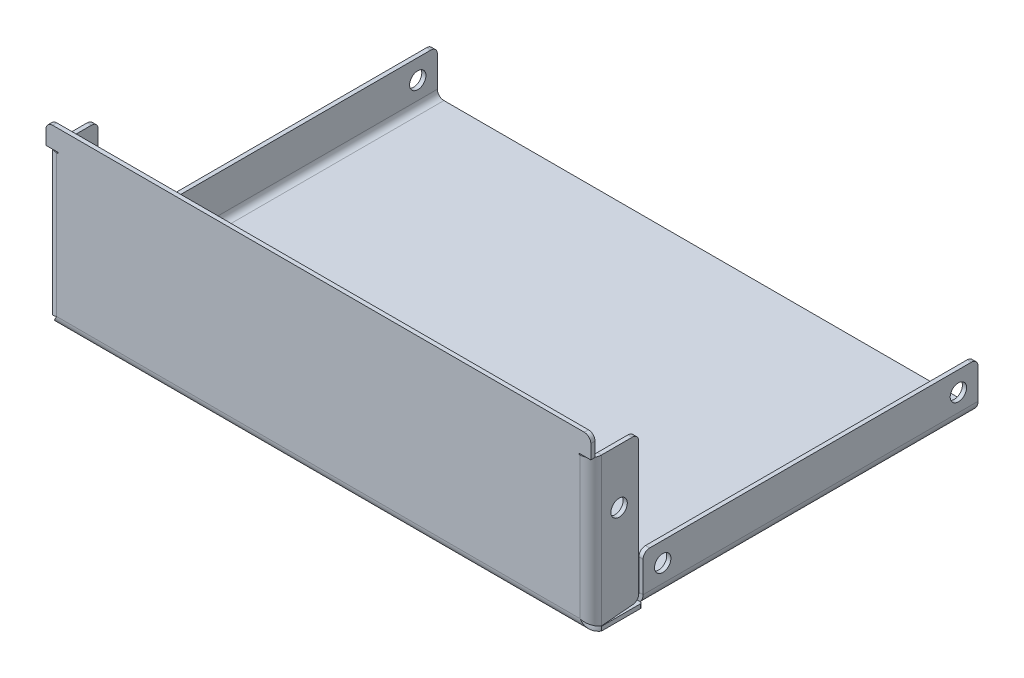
ISO-10303-21;
HEADER;
FILE_DESCRIPTION(('STEP AP214'),'2;1');
FILE_NAME('part.step','',(''),(''),'','','');
FILE_SCHEMA(('AUTOMOTIVE_DESIGN { 1 0 10303 214 1 1 1 1 }'));
ENDSEC;
DATA;
#1=APPLICATION_CONTEXT('core data for automotive mechanical design processes');
#2=APPLICATION_PROTOCOL_DEFINITION('international standard','automotive_design',2000,#1);
#3=PRODUCT_CONTEXT('',#1,'mechanical');
#4=PRODUCT('Part','Part','',(#3));
#5=PRODUCT_RELATED_PRODUCT_CATEGORY('part','',(#4));
#6=PRODUCT_DEFINITION_FORMATION('','',#4);
#7=PRODUCT_DEFINITION_CONTEXT('part definition',#1,'design');
#8=PRODUCT_DEFINITION('design','',#6,#7);
#9=PRODUCT_DEFINITION_SHAPE('','',#8);
#10=(LENGTH_UNIT() NAMED_UNIT(*) SI_UNIT(.MILLI.,.METRE.));
#11=(NAMED_UNIT(*) PLANE_ANGLE_UNIT() SI_UNIT($,.RADIAN.));
#12=(NAMED_UNIT(*) SI_UNIT($,.STERADIAN.) SOLID_ANGLE_UNIT());
#13=UNCERTAINTY_MEASURE_WITH_UNIT(LENGTH_MEASURE(1.E-05),#10,'distance_accuracy_value','');
#14=(GEOMETRIC_REPRESENTATION_CONTEXT(3) GLOBAL_UNCERTAINTY_ASSIGNED_CONTEXT((#13)) GLOBAL_UNIT_ASSIGNED_CONTEXT((#10,
#11,#12)) REPRESENTATION_CONTEXT('',''));
#15=CARTESIAN_POINT('',(0.,0.,0.));
#16=DIRECTION('',(0.,0.,1.));
#17=DIRECTION('',(1.,0.,0.));
#18=AXIS2_PLACEMENT_3D('',#15,#16,#17);
#19=CARTESIAN_POINT('',(-79.3749999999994,3.12419994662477,-13.9700000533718));
#20=DIRECTION('',(0.,0.,-1.));
#21=DIRECTION('',(0.,1.,0.));
#22=AXIS2_PLACEMENT_3D('',#19,#20,#21);
#23=PLANE('',#22);
#24=DIRECTION('',(0.,-1.,0.));
#25=VECTOR('',#24,1.);
#26=CARTESIAN_POINT('',(-79.3749999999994,3.12419994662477,-13.9700000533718));
#27=LINE('',#26,#25);
#28=CARTESIAN_POINT('',(-79.3749999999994,4.00513538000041,-13.9700000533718));
#29=VERTEX_POINT('',#28);
#30=CARTESIAN_POINT('',(-79.3749999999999,42.5449999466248,-13.9700000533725));
#31=VERTEX_POINT('',#30);
#32=EDGE_CURVE('E653',#29,#31,#27,.F.);
#33=ORIENTED_EDGE('',*,*,#32,.T.);
#34=DIRECTION('',(1.,0.,0.));
#35=VECTOR('',#34,1.);
#36=CARTESIAN_POINT('',(-79.3749999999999,42.5449999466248,-13.9700000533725));
#37=LINE('',#36,#35);
#38=CARTESIAN_POINT('',(-78.1557999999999,42.5449999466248,-13.9700000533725));
#39=VERTEX_POINT('',#38);
#40=EDGE_CURVE('E1402',#31,#39,#37,.T.);
#41=ORIENTED_EDGE('',*,*,#40,.T.);
#42=DIRECTION('',(0.,1.,0.));
#43=VECTOR('',#42,1.);
#44=CARTESIAN_POINT('',(-78.1557999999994,3.12419994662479,-13.9700000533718));
#45=LINE('',#44,#43);
#46=CARTESIAN_POINT('',(-78.1557999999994,4.00513538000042,-13.9700000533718));
#47=VERTEX_POINT('',#46);
#48=EDGE_CURVE('E512',#47,#39,#45,.T.);
#49=ORIENTED_EDGE('',*,*,#48,.F.);
#50=DIRECTION('',(1.,0.,0.));
#51=VECTOR('',#50,1.);
#52=CARTESIAN_POINT('',(-79.3749999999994,4.00513538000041,-13.9700000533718));
#53=LINE('',#52,#51);
#54=EDGE_CURVE('E1399',#47,#29,#53,.F.);
#55=ORIENTED_EDGE('',*,*,#54,.T.);
#56=EDGE_LOOP('',(#33,#41,#49,#55));
#57=FACE_BOUND('',#56,.T.);
#58=ADVANCED_FACE('F151',(#57),#23,.T.);
#59=CARTESIAN_POINT('',(-78.1557999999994,3.12419994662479,-13.9700000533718));
#60=DIRECTION('',(1.,0.,0.));
#61=DIRECTION('',(0.,0.,-1.));
#62=AXIS2_PLACEMENT_3D('',#59,#60,#61);
#63=PLANE('',#62);
#64=CARTESIAN_POINT('',(-78.1557999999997,28.5749996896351,-8.25500003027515));
#65=DIRECTION('',(1.,0.,0.));
#66=DIRECTION('',(0.,0.,-1.));
#67=AXIS2_PLACEMENT_3D('',#64,#65,#66);
#68=CIRCLE('',#67,2.3876);
#69=CARTESIAN_POINT('',(-78.1557999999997,28.5749996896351,-10.6426000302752));
#70=VERTEX_POINT('',#69);
#71=EDGE_CURVE('E666',#70,#70,#68,.T.);
#72=ORIENTED_EDGE('',*,*,#71,.F.);
#73=EDGE_LOOP('',(#72));
#74=FACE_BOUND('',#73,.T.);
#75=ORIENTED_EDGE('',*,*,#48,.T.);
#76=CARTESIAN_POINT('',(-78.1557999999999,42.5449999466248,-12.0650000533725));
#77=DIRECTION('',(1.,0.,0.));
#78=DIRECTION('',(0.,1.,0.));
#79=AXIS2_PLACEMENT_3D('',#76,#77,#78);
#80=CIRCLE('',#79,1.905);
#81=CARTESIAN_POINT('',(-78.1558,44.4499999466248,-12.0650000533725));
#82=VERTEX_POINT('',#81);
#83=EDGE_CURVE('E1442',#39,#82,#80,.T.);
#84=ORIENTED_EDGE('',*,*,#83,.T.);
#85=DIRECTION('',(0.,0.,1.));
#86=VECTOR('',#85,1.);
#87=CARTESIAN_POINT('',(-78.1558,44.4499999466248,-13.9700000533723));
#88=LINE('',#87,#86);
#89=CARTESIAN_POINT('',(-78.155800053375,44.4499999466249,-3.12420005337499));
#90=VERTEX_POINT('',#89);
#91=EDGE_CURVE('E492',#82,#90,#88,.T.);
#92=ORIENTED_EDGE('',*,*,#91,.T.);
#93=DIRECTION('',(0.,1.,0.));
#94=VECTOR('',#93,1.);
#95=CARTESIAN_POINT('',(-78.1557999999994,3.12419994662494,-3.12420005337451));
#96=LINE('',#95,#94);
#97=CARTESIAN_POINT('',(-78.1557999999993,1.3106399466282,-3.12420005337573));
#98=VERTEX_POINT('',#97);
#99=EDGE_CURVE('E488',#98,#90,#96,.T.);
#100=ORIENTED_EDGE('',*,*,#99,.F.);
#101=DIRECTION('',(0.,-0.0871557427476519,0.996194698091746));
#102=VECTOR('',#101,1.);
#103=CARTESIAN_POINT('',(-78.1557999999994,2.26609267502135,-14.0450747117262));
#104=LINE('',#103,#102);
#105=CARTESIAN_POINT('',(-78.1557999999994,2.10738448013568,-12.2310317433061));
#106=VERTEX_POINT('',#105);
#107=EDGE_CURVE('E474',#106,#98,#104,.T.);
#108=ORIENTED_EDGE('',*,*,#107,.F.);
#109=CARTESIAN_POINT('',(-78.1557999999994,4.00513538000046,-12.0650000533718));
#110=DIRECTION('',(1.,0.,0.));
#111=DIRECTION('',(0.,1.,0.));
#112=AXIS2_PLACEMENT_3D('',#109,#110,#111);
#113=CIRCLE('',#112,1.905);
#114=EDGE_CURVE('E1404',#106,#47,#113,.T.);
#115=ORIENTED_EDGE('',*,*,#114,.T.);
#116=EDGE_LOOP('',(#75,#84,#92,#100,#108,#115));
#117=FACE_BOUND('',#116,.T.);
#118=ADVANCED_FACE('F490',(#74,#117),#63,.T.);
#119=CARTESIAN_POINT('',(-79.3749999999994,3.12419994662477,-13.9700000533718));
#120=DIRECTION('',(1.,0.,0.));
#121=DIRECTION('',(0.,0.,-1.));
#122=AXIS2_PLACEMENT_3D('',#119,#120,#121);
#123=PLANE('',#122);
#124=CARTESIAN_POINT('',(-79.3749999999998,28.5749996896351,-8.25500003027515));
#125=DIRECTION('',(1.,0.,0.));
#126=DIRECTION('',(0.,1.,0.));
#127=AXIS2_PLACEMENT_3D('',#124,#125,#126);
#128=CIRCLE('',#127,2.3876);
#129=CARTESIAN_POINT('',(-79.3749999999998,30.9625996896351,-8.25500003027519));
#130=VERTEX_POINT('',#129);
#131=EDGE_CURVE('E511',#130,#130,#128,.T.);
#132=ORIENTED_EDGE('',*,*,#131,.T.);
#133=EDGE_LOOP('',(#132));
#134=FACE_BOUND('',#133,.T.);
#135=DIRECTION('',(0.,0.,-1.));
#136=VECTOR('',#135,1.);
#137=CARTESIAN_POINT('',(-79.375,44.4499999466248,-13.9700000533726));
#138=LINE('',#137,#136);
#139=CARTESIAN_POINT('',(-79.375,44.4499999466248,-12.0650000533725));
#140=VERTEX_POINT('',#139);
#141=CARTESIAN_POINT('',(-79.3749999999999,44.4499999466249,-3.1242000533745));
#142=VERTEX_POINT('',#141);
#143=EDGE_CURVE('E656',#140,#142,#138,.F.);
#144=ORIENTED_EDGE('',*,*,#143,.F.);
#145=CARTESIAN_POINT('',(-79.3749999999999,42.5449999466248,-12.0650000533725));
#146=DIRECTION('',(1.,0.,0.));
#147=DIRECTION('',(0.,1.,0.));
#148=AXIS2_PLACEMENT_3D('',#145,#146,#147);
#149=CIRCLE('',#148,1.905);
#150=EDGE_CURVE('E1432',#140,#31,#149,.F.);
#151=ORIENTED_EDGE('',*,*,#150,.T.);
#152=ORIENTED_EDGE('',*,*,#32,.F.);
#153=CARTESIAN_POINT('',(-79.3749999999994,4.00513538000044,-12.0650000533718));
#154=DIRECTION('',(1.,0.,0.));
#155=DIRECTION('',(0.,1.,0.));
#156=AXIS2_PLACEMENT_3D('',#153,#154,#155);
#157=CIRCLE('',#156,1.905);
#158=CARTESIAN_POINT('',(-79.3749999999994,2.10738448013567,-12.2310317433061));
#159=VERTEX_POINT('',#158);
#160=EDGE_CURVE('E1433',#29,#159,#157,.F.);
#161=ORIENTED_EDGE('',*,*,#160,.T.);
#162=DIRECTION('',(0.,-0.0871557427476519,0.996194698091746));
#163=VECTOR('',#162,1.);
#164=CARTESIAN_POINT('',(-79.3749999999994,2.26609267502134,-14.0450747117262));
#165=LINE('',#164,#163);
#166=CARTESIAN_POINT('',(-79.3749999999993,1.31063994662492,-3.12420005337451));
#167=VERTEX_POINT('',#166);
#168=EDGE_CURVE('E485',#159,#167,#165,.T.);
#169=ORIENTED_EDGE('',*,*,#168,.T.);
#170=DIRECTION('',(0.,-1.,0.));
#171=VECTOR('',#170,1.);
#172=CARTESIAN_POINT('',(-79.3749999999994,3.12419994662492,-3.12420005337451));
#173=LINE('',#172,#171);
#174=EDGE_CURVE('E651',#142,#167,#173,.T.);
#175=ORIENTED_EDGE('',*,*,#174,.F.);
#176=EDGE_LOOP('',(#144,#151,#152,#161,#169,#175));
#177=FACE_BOUND('',#176,.T.);
#178=ADVANCED_FACE('F745',(#134,#177),#123,.F.);
#179=CARTESIAN_POINT('',(79.3750000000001,3.12419994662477,-13.9700000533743));
#180=DIRECTION('',(0.,0.,-1.));
#181=DIRECTION('',(0.,1.,0.));
#182=AXIS2_PLACEMENT_3D('',#179,#180,#181);
#183=PLANE('',#182);
#184=DIRECTION('',(0.,1.,0.));
#185=VECTOR('',#184,1.);
#186=CARTESIAN_POINT('',(78.1558000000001,3.12419994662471,-13.9700000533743));
#187=LINE('',#186,#185);
#188=CARTESIAN_POINT('',(78.1558000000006,42.5449999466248,-13.970000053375));
#189=VERTEX_POINT('',#188);
#190=CARTESIAN_POINT('',(78.1558000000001,4.00513537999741,-13.9700000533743));
#191=VERTEX_POINT('',#190);
#192=EDGE_CURVE('E1422',#189,#191,#187,.F.);
#193=ORIENTED_EDGE('',*,*,#192,.F.);
#194=DIRECTION('',(-1.,0.,0.));
#195=VECTOR('',#194,1.);
#196=CARTESIAN_POINT('',(79.3750000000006,42.5449999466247,-13.970000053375));
#197=LINE('',#196,#195);
#198=CARTESIAN_POINT('',(79.3750000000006,42.5449999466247,-13.970000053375));
#199=VERTEX_POINT('',#198);
#200=EDGE_CURVE('E1233',#189,#199,#197,.F.);
#201=ORIENTED_EDGE('',*,*,#200,.T.);
#202=DIRECTION('',(0.,-1.,0.));
#203=VECTOR('',#202,1.);
#204=CARTESIAN_POINT('',(79.3750000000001,3.12419994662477,-13.9700000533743));
#205=LINE('',#204,#203);
#206=CARTESIAN_POINT('',(79.3750000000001,4.0051353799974,-13.9700000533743));
#207=VERTEX_POINT('',#206);
#208=EDGE_CURVE('E1341',#199,#207,#205,.T.);
#209=ORIENTED_EDGE('',*,*,#208,.T.);
#210=DIRECTION('',(-1.,0.,0.));
#211=VECTOR('',#210,1.);
#212=CARTESIAN_POINT('',(79.3750000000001,4.0051353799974,-13.9700000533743));
#213=LINE('',#212,#211);
#214=EDGE_CURVE('E1418',#207,#191,#213,.T.);
#215=ORIENTED_EDGE('',*,*,#214,.T.);
#216=EDGE_LOOP('',(#193,#201,#209,#215));
#217=FACE_BOUND('',#216,.T.);
#218=ADVANCED_FACE('F738',(#217),#183,.T.);
#219=CARTESIAN_POINT('',(78.1558,3.12419994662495,-1.21920005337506));
#220=DIRECTION('',(1.,0.,0.));
#221=DIRECTION('',(0.,0.,-1.));
#222=AXIS2_PLACEMENT_3D('',#219,#220,#221);
#223=PLANE('',#222);
#224=CARTESIAN_POINT('',(78.1558000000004,28.5749996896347,-8.2550000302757));
#225=DIRECTION('',(1.,0.,0.));
#226=DIRECTION('',(0.,0.,-1.));
#227=AXIS2_PLACEMENT_3D('',#224,#225,#226);
#228=CIRCLE('',#227,2.3876);
#229=CARTESIAN_POINT('',(78.1558000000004,28.5749996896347,-10.6426000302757));
#230=VERTEX_POINT('',#229);
#231=EDGE_CURVE('E2240',#230,#230,#228,.T.);
#232=ORIENTED_EDGE('',*,*,#231,.T.);
#233=EDGE_LOOP('',(#232));
#234=FACE_BOUND('',#233,.T.);
#235=DIRECTION('',(0.,0.,1.));
#236=VECTOR('',#235,1.);
#237=CARTESIAN_POINT('',(78.1558000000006,44.4499999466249,-1.21920005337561));
#238=LINE('',#237,#236);
#239=CARTESIAN_POINT('',(78.1558000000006,44.449999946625,-3.12420005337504));
#240=VERTEX_POINT('',#239);
#241=CARTESIAN_POINT('',(78.1558000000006,44.4499999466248,-12.065000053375));
#242=VERTEX_POINT('',#241);
#243=EDGE_CURVE('E2235',#240,#242,#238,.F.);
#244=ORIENTED_EDGE('',*,*,#243,.T.);
#245=CARTESIAN_POINT('',(78.1558000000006,42.5449999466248,-12.065000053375));
#246=DIRECTION('',(1.,0.,0.));
#247=DIRECTION('',(0.,1.,0.));
#248=AXIS2_PLACEMENT_3D('',#245,#246,#247);
#249=CIRCLE('',#248,1.905);
#250=EDGE_CURVE('E1417',#242,#189,#249,.F.);
#251=ORIENTED_EDGE('',*,*,#250,.T.);
#252=ORIENTED_EDGE('',*,*,#192,.T.);
#253=CARTESIAN_POINT('',(78.1558000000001,4.00513537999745,-12.0650000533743));
#254=DIRECTION('',(1.,0.,0.));
#255=DIRECTION('',(0.,1.,0.));
#256=AXIS2_PLACEMENT_3D('',#253,#254,#255);
#257=CIRCLE('',#256,1.905);
#258=CARTESIAN_POINT('',(78.1558,2.10738448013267,-12.2310317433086));
#259=VERTEX_POINT('',#258);
#260=EDGE_CURVE('E1415',#191,#259,#257,.F.);
#261=ORIENTED_EDGE('',*,*,#260,.T.);
#262=DIRECTION('',(0.,-0.0871557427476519,0.996194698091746));
#263=VECTOR('',#262,1.);
#264=CARTESIAN_POINT('',(78.1558,1.15901608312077,-1.39113136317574));
#265=LINE('',#264,#263);
#266=CARTESIAN_POINT('',(78.155800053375,1.31063994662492,-3.12420005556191));
#267=VERTEX_POINT('',#266);
#268=EDGE_CURVE('E1237',#259,#267,#265,.T.);
#269=ORIENTED_EDGE('',*,*,#268,.T.);
#270=DIRECTION('',(0.,-1.,0.));
#271=VECTOR('',#270,1.);
#272=CARTESIAN_POINT('',(78.1558000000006,44.4499999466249,-3.12420005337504));
#273=LINE('',#272,#271);
#274=EDGE_CURVE('E1168',#240,#267,#273,.T.);
#275=ORIENTED_EDGE('',*,*,#274,.F.);
#276=EDGE_LOOP('',(#244,#251,#252,#261,#269,#275));
#277=FACE_BOUND('',#276,.T.);
#278=ADVANCED_FACE('F728',(#234,#277),#223,.F.);
#279=CARTESIAN_POINT('',(79.375,3.12419994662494,-1.21920005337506));
#280=DIRECTION('',(1.,0.,0.));
#281=DIRECTION('',(0.,0.,-1.));
#282=AXIS2_PLACEMENT_3D('',#279,#280,#281);
#283=PLANE('',#282);
#284=CARTESIAN_POINT('',(79.3750000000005,28.5749996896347,-8.2550000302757));
#285=DIRECTION('',(1.,0.,0.));
#286=DIRECTION('',(0.,1.,0.));
#287=AXIS2_PLACEMENT_3D('',#284,#285,#286);
#288=CIRCLE('',#287,2.3876);
#289=CARTESIAN_POINT('',(79.3750000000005,30.9625996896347,-8.25500003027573));
#290=VERTEX_POINT('',#289);
#291=EDGE_CURVE('E1426',#290,#290,#288,.T.);
#292=ORIENTED_EDGE('',*,*,#291,.F.);
#293=EDGE_LOOP('',(#292));
#294=FACE_BOUND('',#293,.T.);
#295=ORIENTED_EDGE('',*,*,#208,.F.);
#296=CARTESIAN_POINT('',(79.3750000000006,42.5449999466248,-12.065000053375));
#297=DIRECTION('',(1.,0.,0.));
#298=DIRECTION('',(0.,1.,0.));
#299=AXIS2_PLACEMENT_3D('',#296,#297,#298);
#300=CIRCLE('',#299,1.905);
#301=CARTESIAN_POINT('',(79.3750000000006,44.4499999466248,-12.065000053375));
#302=VERTEX_POINT('',#301);
#303=EDGE_CURVE('E1228',#199,#302,#300,.T.);
#304=ORIENTED_EDGE('',*,*,#303,.T.);
#305=DIRECTION('',(0.,0.,-1.));
#306=VECTOR('',#305,1.);
#307=CARTESIAN_POINT('',(79.3750000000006,44.4499999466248,-13.970000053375));
#308=LINE('',#307,#306);
#309=CARTESIAN_POINT('',(79.3750000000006,44.4499999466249,-3.12420005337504));
#310=VERTEX_POINT('',#309);
#311=EDGE_CURVE('E1319',#310,#302,#308,.T.);
#312=ORIENTED_EDGE('',*,*,#311,.F.);
#313=DIRECTION('',(0.,-1.,0.));
#314=VECTOR('',#313,1.);
#315=CARTESIAN_POINT('',(79.375,3.12419994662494,-3.12420005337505));
#316=LINE('',#315,#314);
#317=CARTESIAN_POINT('',(79.375,1.31063994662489,-3.12420005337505));
#318=VERTEX_POINT('',#317);
#319=EDGE_CURVE('E1316',#310,#318,#316,.T.);
#320=ORIENTED_EDGE('',*,*,#319,.T.);
#321=DIRECTION('',(0.,-0.0871557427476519,0.996194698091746));
#322=VECTOR('',#321,1.);
#323=CARTESIAN_POINT('',(79.375,1.15901608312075,-1.39113136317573));
#324=LINE('',#323,#322);
#325=CARTESIAN_POINT('',(79.375,2.10738448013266,-12.2310317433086));
#326=VERTEX_POINT('',#325);
#327=EDGE_CURVE('E1234',#326,#318,#324,.T.);
#328=ORIENTED_EDGE('',*,*,#327,.F.);
#329=CARTESIAN_POINT('',(79.3750000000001,4.00513537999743,-12.0650000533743));
#330=DIRECTION('',(1.,0.,0.));
#331=DIRECTION('',(0.,1.,0.));
#332=AXIS2_PLACEMENT_3D('',#329,#330,#331);
#333=CIRCLE('',#332,1.905);
#334=EDGE_CURVE('E166',#326,#207,#333,.T.);
#335=ORIENTED_EDGE('',*,*,#334,.T.);
#336=EDGE_LOOP('',(#295,#304,#312,#320,#328,#335));
#337=FACE_BOUND('',#336,.T.);
#338=ADVANCED_FACE('F725',(#294,#337),#283,.T.);
#339=CARTESIAN_POINT('',(-79.375,3.12419994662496,-3.12420005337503));
#340=DIRECTION('',(1.,0.,0.));
#341=DIRECTION('',(0.,0.,-1.));
#342=AXIS2_PLACEMENT_3D('',#339,#340,#341);
#343=PLANE('',#342);
#344=DIRECTION('',(0.,-1.,0.));
#345=VECTOR('',#344,1.);
#346=CARTESIAN_POINT('',(-79.375,50.799999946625,-5.33750250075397E-08));
#347=LINE('',#346,#345);
#348=CARTESIAN_POINT('',(-79.375,48.894999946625,-5.33750250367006E-08));
#349=VERTEX_POINT('',#348);
#350=CARTESIAN_POINT('',(-79.375,44.7547999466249,-5.33750251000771E-08));
#351=VERTEX_POINT('',#350);
#352=EDGE_CURVE('E579',#349,#351,#347,.T.);
#353=ORIENTED_EDGE('',*,*,#352,.F.);
#354=DIRECTION('',(0.,0.,-1.));
#355=VECTOR('',#354,1.);
#356=CARTESIAN_POINT('',(-79.375,48.894999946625,-1.21920005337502));
#357=LINE('',#356,#355);
#358=CARTESIAN_POINT('',(-79.375,48.894999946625,-1.21920005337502));
#359=VERTEX_POINT('',#358);
#360=EDGE_CURVE('E1473',#349,#359,#357,.T.);
#361=ORIENTED_EDGE('',*,*,#360,.T.);
#362=DIRECTION('',(0.,-1.,0.));
#363=VECTOR('',#362,1.);
#364=CARTESIAN_POINT('',(-79.375,50.799999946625,-1.21920005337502));
#365=LINE('',#364,#363);
#366=CARTESIAN_POINT('',(-79.375,44.7547999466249,-1.21920005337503));
#367=VERTEX_POINT('',#366);
#368=EDGE_CURVE('E525',#359,#367,#365,.T.);
#369=ORIENTED_EDGE('',*,*,#368,.T.);
#370=DIRECTION('',(0.,0.,1.));
#371=VECTOR('',#370,1.);
#372=CARTESIAN_POINT('',(-79.375,44.7547999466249,-1.21920005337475));
#373=LINE('',#372,#371);
#374=EDGE_CURVE('E519',#367,#351,#373,.T.);
#375=ORIENTED_EDGE('',*,*,#374,.T.);
#376=EDGE_LOOP('',(#353,#361,#369,#375));
#377=FACE_BOUND('',#376,.T.);
#378=ADVANCED_FACE('F555',(#377),#343,.F.);
#379=CARTESIAN_POINT('',(79.375,50.799999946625,-5.33750250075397E-08));
#380=DIRECTION('',(0.,1.,0.));
#381=DIRECTION('',(0.,0.,1.));
#382=AXIS2_PLACEMENT_3D('',#379,#380,#381);
#383=PLANE('',#382);
#384=DIRECTION('',(-1.,0.,0.));
#385=VECTOR('',#384,1.);
#386=CARTESIAN_POINT('',(79.375,50.799999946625,-5.33750250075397E-08));
#387=LINE('',#386,#385);
#388=CARTESIAN_POINT('',(77.47,50.799999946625,-5.33750250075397E-08));
#389=VERTEX_POINT('',#388);
#390=CARTESIAN_POINT('',(-77.47,50.799999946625,-5.33750250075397E-08));
#391=VERTEX_POINT('',#390);
#392=EDGE_CURVE('E581',#389,#391,#387,.T.);
#393=ORIENTED_EDGE('',*,*,#392,.F.);
#394=DIRECTION('',(0.,0.,-1.));
#395=VECTOR('',#394,1.);
#396=CARTESIAN_POINT('',(77.47,50.799999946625,-5.33750250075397E-08));
#397=LINE('',#396,#395);
#398=CARTESIAN_POINT('',(77.47,50.799999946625,-1.21920005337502));
#399=VERTEX_POINT('',#398);
#400=EDGE_CURVE('E1478',#389,#399,#397,.T.);
#401=ORIENTED_EDGE('',*,*,#400,.T.);
#402=DIRECTION('',(-1.,0.,0.));
#403=VECTOR('',#402,1.);
#404=CARTESIAN_POINT('',(79.375,50.799999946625,-1.21920005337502));
#405=LINE('',#404,#403);
#406=CARTESIAN_POINT('',(-77.47,50.799999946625,-1.21920005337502));
#407=VERTEX_POINT('',#406);
#408=EDGE_CURVE('E634',#399,#407,#405,.T.);
#409=ORIENTED_EDGE('',*,*,#408,.T.);
#410=DIRECTION('',(0.,0.,-1.));
#411=VECTOR('',#410,1.);
#412=CARTESIAN_POINT('',(-77.47,50.799999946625,-5.33750248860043E-08));
#413=LINE('',#412,#411);
#414=EDGE_CURVE('E1295',#407,#391,#413,.F.);
#415=ORIENTED_EDGE('',*,*,#414,.T.);
#416=EDGE_LOOP('',(#393,#401,#409,#415));
#417=FACE_BOUND('',#416,.T.);
#418=ADVANCED_FACE('F1483',(#417),#383,.T.);
#419=CARTESIAN_POINT('',(79.375,1.21919994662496,-3.12420005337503));
#420=DIRECTION('',(1.,0.,0.));
#421=DIRECTION('',(0.,0.,-1.));
#422=AXIS2_PLACEMENT_3D('',#419,#420,#421);
#423=PLANE('',#422);
#424=DIRECTION('',(0.,-1.,0.));
#425=VECTOR('',#424,1.);
#426=CARTESIAN_POINT('',(79.375,50.799999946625,-1.21920005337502));
#427=LINE('',#426,#425);
#428=CARTESIAN_POINT('',(79.375,48.894999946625,-1.21920005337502));
#429=VERTEX_POINT('',#428);
#430=CARTESIAN_POINT('',(79.375,44.754799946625,-1.21920005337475));
#431=VERTEX_POINT('',#430);
#432=EDGE_CURVE('E572',#429,#431,#427,.T.);
#433=ORIENTED_EDGE('',*,*,#432,.F.);
#434=DIRECTION('',(0.,0.,-1.));
#435=VECTOR('',#434,1.);
#436=CARTESIAN_POINT('',(79.375,48.894999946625,-3.12420005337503));
#437=LINE('',#436,#435);
#438=CARTESIAN_POINT('',(79.375,48.894999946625,-5.33750250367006E-08));
#439=VERTEX_POINT('',#438);
#440=EDGE_CURVE('E1495',#429,#439,#437,.F.);
#441=ORIENTED_EDGE('',*,*,#440,.T.);
#442=DIRECTION('',(0.,-1.,0.));
#443=VECTOR('',#442,1.);
#444=CARTESIAN_POINT('',(79.375,50.799999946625,-5.33750250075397E-08));
#445=LINE('',#444,#443);
#446=CARTESIAN_POINT('',(79.375,44.754799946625,-5.33750251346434E-08));
#447=VERTEX_POINT('',#446);
#448=EDGE_CURVE('E632',#439,#447,#445,.T.);
#449=ORIENTED_EDGE('',*,*,#448,.T.);
#450=DIRECTION('',(0.,0.,1.));
#451=VECTOR('',#450,1.);
#452=CARTESIAN_POINT('',(79.375,44.754799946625,-1.21920005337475));
#453=LINE('',#452,#451);
#454=EDGE_CURVE('E629',#431,#447,#453,.T.);
#455=ORIENTED_EDGE('',*,*,#454,.F.);
#456=EDGE_LOOP('',(#433,#441,#449,#455));
#457=FACE_BOUND('',#456,.T.);
#458=ADVANCED_FACE('F1836',(#457),#423,.T.);
#459=CARTESIAN_POINT('',(75.946,44.754799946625,-1.21920005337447));
#460=DIRECTION('',(0.,-1.,0.));
#461=DIRECTION('',(0.,0.,-1.));
#462=AXIS2_PLACEMENT_3D('',#459,#460,#461);
#463=PLANE('',#462);
#464=ORIENTED_EDGE('',*,*,#454,.T.);
#465=DIRECTION('',(-1.,0.,0.));
#466=VECTOR('',#465,1.);
#467=CARTESIAN_POINT('',(79.375,44.754799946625,-5.33750251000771E-08));
#468=LINE('',#467,#466);
#469=CARTESIAN_POINT('',(75.946,44.754799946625,-5.33750251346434E-08));
#470=VERTEX_POINT('',#469);
#471=EDGE_CURVE('E627',#447,#470,#468,.T.);
#472=ORIENTED_EDGE('',*,*,#471,.T.);
#473=DIRECTION('',(0.,0.,1.));
#474=VECTOR('',#473,1.);
#475=CARTESIAN_POINT('',(75.946,44.754799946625,-1.21920005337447));
#476=LINE('',#475,#474);
#477=CARTESIAN_POINT('',(75.946,44.754799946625,-1.21920005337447));
#478=VERTEX_POINT('',#477);
#479=EDGE_CURVE('E621',#478,#470,#476,.T.);
#480=ORIENTED_EDGE('',*,*,#479,.F.);
#481=DIRECTION('',(1.,0.,0.));
#482=VECTOR('',#481,1.);
#483=CARTESIAN_POINT('',(75.946,44.754799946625,-1.21920005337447));
#484=LINE('',#483,#482);
#485=EDGE_CURVE('E624',#478,#431,#484,.T.);
#486=ORIENTED_EDGE('',*,*,#485,.T.);
#487=EDGE_LOOP('',(#464,#472,#480,#486));
#488=FACE_BOUND('',#487,.T.);
#489=ADVANCED_FACE('F1830',(#488),#463,.T.);
#490=CARTESIAN_POINT('',(75.946,44.449999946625,-1.21920005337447));
#491=DIRECTION('',(1.,0.,0.));
#492=DIRECTION('',(0.,0.,-1.));
#493=AXIS2_PLACEMENT_3D('',#490,#491,#492);
#494=PLANE('',#493);
#495=ORIENTED_EDGE('',*,*,#479,.T.);
#496=DIRECTION('',(0.,-1.,0.));
#497=VECTOR('',#496,1.);
#498=CARTESIAN_POINT('',(75.946,50.799999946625,-5.33750250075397E-08));
#499=LINE('',#498,#497);
#500=CARTESIAN_POINT('',(75.946,44.449999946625,-5.33750251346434E-08));
#501=VERTEX_POINT('',#500);
#502=EDGE_CURVE('E619',#470,#501,#499,.T.);
#503=ORIENTED_EDGE('',*,*,#502,.T.);
#504=DIRECTION('',(0.,0.,1.));
#505=VECTOR('',#504,1.);
#506=CARTESIAN_POINT('',(75.946,44.449999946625,-1.21920005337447));
#507=LINE('',#506,#505);
#508=CARTESIAN_POINT('',(75.946,44.449999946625,-1.21920005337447));
#509=VERTEX_POINT('',#508);
#510=EDGE_CURVE('E613',#509,#501,#507,.T.);
#511=ORIENTED_EDGE('',*,*,#510,.F.);
#512=DIRECTION('',(0.,1.,0.));
#513=VECTOR('',#512,1.);
#514=CARTESIAN_POINT('',(75.946,44.449999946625,-1.21920005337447));
#515=LINE('',#514,#513);
#516=EDGE_CURVE('E616',#509,#478,#515,.T.);
#517=ORIENTED_EDGE('',*,*,#516,.T.);
#518=EDGE_LOOP('',(#495,#503,#511,#517));
#519=FACE_BOUND('',#518,.T.);
#520=ADVANCED_FACE('F1827',(#519),#494,.T.);
#521=CARTESIAN_POINT('',(76.2508,44.449999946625,-1.21920005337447));
#522=DIRECTION('',(0.,1.,0.));
#523=DIRECTION('',(0.,0.,1.));
#524=AXIS2_PLACEMENT_3D('',#521,#522,#523);
#525=PLANE('',#524);
#526=ORIENTED_EDGE('',*,*,#510,.T.);
#527=DIRECTION('',(1.,0.,0.));
#528=VECTOR('',#527,1.);
#529=CARTESIAN_POINT('',(79.375,44.449999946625,-5.33750251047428E-08));
#530=LINE('',#529,#528);
#531=CARTESIAN_POINT('',(76.2508,44.449999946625,-5.33750251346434E-08));
#532=VERTEX_POINT('',#531);
#533=EDGE_CURVE('E611',#501,#532,#530,.T.);
#534=ORIENTED_EDGE('',*,*,#533,.T.);
#535=DIRECTION('',(0.,0.,1.));
#536=VECTOR('',#535,1.);
#537=CARTESIAN_POINT('',(76.2508,44.449999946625,-1.21920005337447));
#538=LINE('',#537,#536);
#539=CARTESIAN_POINT('',(76.2508,44.449999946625,-1.21920005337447));
#540=VERTEX_POINT('',#539);
#541=EDGE_CURVE('E1307',#540,#532,#538,.T.);
#542=ORIENTED_EDGE('',*,*,#541,.F.);
#543=DIRECTION('',(-1.,0.,0.));
#544=VECTOR('',#543,1.);
#545=CARTESIAN_POINT('',(76.2508,44.449999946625,-1.21920005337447));
#546=LINE('',#545,#544);
#547=EDGE_CURVE('E608',#540,#509,#546,.T.);
#548=ORIENTED_EDGE('',*,*,#547,.T.);
#549=EDGE_LOOP('',(#526,#534,#542,#548));
#550=FACE_BOUND('',#549,.T.);
#551=ADVANCED_FACE('F1824',(#550),#525,.T.);
#552=CARTESIAN_POINT('',(-75.946,44.4499999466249,-1.21920005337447));
#553=DIRECTION('',(0.,1.,0.));
#554=DIRECTION('',(0.,0.,1.));
#555=AXIS2_PLACEMENT_3D('',#552,#553,#554);
#556=PLANE('',#555);
#557=DIRECTION('',(0.,0.,1.));
#558=VECTOR('',#557,1.);
#559=CARTESIAN_POINT('',(-76.2508,44.4499999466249,-1.21920005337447));
#560=LINE('',#559,#558);
#561=CARTESIAN_POINT('',(-76.2508,44.4499999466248,-1.21920002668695));
#562=VERTEX_POINT('',#561);
#563=CARTESIAN_POINT('',(-76.2508,44.4499999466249,-5.33750251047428E-08));
#564=VERTEX_POINT('',#563);
#565=EDGE_CURVE('E644',#562,#564,#560,.T.);
#566=ORIENTED_EDGE('',*,*,#565,.T.);
#567=DIRECTION('',(1.,0.,0.));
#568=VECTOR('',#567,1.);
#569=CARTESIAN_POINT('',(79.375,44.4499999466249,-5.33750251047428E-08));
#570=LINE('',#569,#568);
#571=CARTESIAN_POINT('',(-75.946,44.4499999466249,-5.33750251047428E-08));
#572=VERTEX_POINT('',#571);
#573=EDGE_CURVE('E605',#564,#572,#570,.T.);
#574=ORIENTED_EDGE('',*,*,#573,.T.);
#575=DIRECTION('',(0.,0.,1.));
#576=VECTOR('',#575,1.);
#577=CARTESIAN_POINT('',(-75.946,44.4499999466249,-1.21920005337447));
#578=LINE('',#577,#576);
#579=CARTESIAN_POINT('',(-75.946,44.4499999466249,-1.21920005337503));
#580=VERTEX_POINT('',#579);
#581=EDGE_CURVE('E599',#580,#572,#578,.T.);
#582=ORIENTED_EDGE('',*,*,#581,.F.);
#583=DIRECTION('',(-1.,0.,0.));
#584=VECTOR('',#583,1.);
#585=CARTESIAN_POINT('',(-75.946,44.4499999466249,-1.21920005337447));
#586=LINE('',#585,#584);
#587=EDGE_CURVE('E602',#580,#562,#586,.T.);
#588=ORIENTED_EDGE('',*,*,#587,.T.);
#589=EDGE_LOOP('',(#566,#574,#582,#588));
#590=FACE_BOUND('',#589,.T.);
#591=ADVANCED_FACE('F1460',(#590),#556,.T.);
#592=CARTESIAN_POINT('',(-75.946,44.7547999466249,-1.21920005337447));
#593=DIRECTION('',(-1.,0.,0.));
#594=DIRECTION('',(0.,0.,1.));
#595=AXIS2_PLACEMENT_3D('',#592,#593,#594);
#596=PLANE('',#595);
#597=ORIENTED_EDGE('',*,*,#581,.T.);
#598=DIRECTION('',(0.,1.,0.));
#599=VECTOR('',#598,1.);
#600=CARTESIAN_POINT('',(-75.946,50.799999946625,-5.33750250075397E-08));
#601=LINE('',#600,#599);
#602=CARTESIAN_POINT('',(-75.946,44.7547999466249,-5.33750251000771E-08));
#603=VERTEX_POINT('',#602);
#604=EDGE_CURVE('E596',#572,#603,#601,.T.);
#605=ORIENTED_EDGE('',*,*,#604,.T.);
#606=DIRECTION('',(0.,0.,1.));
#607=VECTOR('',#606,1.);
#608=CARTESIAN_POINT('',(-75.946,44.7547999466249,-1.21920005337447));
#609=LINE('',#608,#607);
#610=CARTESIAN_POINT('',(-75.946,44.7547999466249,-1.21920005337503));
#611=VERTEX_POINT('',#610);
#612=EDGE_CURVE('E590',#611,#603,#609,.T.);
#613=ORIENTED_EDGE('',*,*,#612,.F.);
#614=DIRECTION('',(0.,-1.,0.));
#615=VECTOR('',#614,1.);
#616=CARTESIAN_POINT('',(-75.946,44.7547999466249,-1.21920005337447));
#617=LINE('',#616,#615);
#618=EDGE_CURVE('E593',#611,#580,#617,.T.);
#619=ORIENTED_EDGE('',*,*,#618,.T.);
#620=EDGE_LOOP('',(#597,#605,#613,#619));
#621=FACE_BOUND('',#620,.T.);
#622=ADVANCED_FACE('F1466',(#621),#596,.T.);
#623=CARTESIAN_POINT('',(-79.375,44.7547999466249,-1.21920005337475));
#624=DIRECTION('',(0.,-1.,0.));
#625=DIRECTION('',(0.,0.,-1.));
#626=AXIS2_PLACEMENT_3D('',#623,#624,#625);
#627=PLANE('',#626);
#628=ORIENTED_EDGE('',*,*,#612,.T.);
#629=DIRECTION('',(-1.,0.,0.));
#630=VECTOR('',#629,1.);
#631=CARTESIAN_POINT('',(79.375,44.7547999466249,-5.33750251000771E-08));
#632=LINE('',#631,#630);
#633=EDGE_CURVE('E587',#603,#351,#632,.T.);
#634=ORIENTED_EDGE('',*,*,#633,.T.);
#635=ORIENTED_EDGE('',*,*,#374,.F.);
#636=DIRECTION('',(1.,0.,0.));
#637=VECTOR('',#636,1.);
#638=CARTESIAN_POINT('',(-79.375,44.7547999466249,-1.21920005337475));
#639=LINE('',#638,#637);
#640=EDGE_CURVE('E584',#367,#611,#639,.T.);
#641=ORIENTED_EDGE('',*,*,#640,.T.);
#642=EDGE_LOOP('',(#628,#634,#635,#641));
#643=FACE_BOUND('',#642,.T.);
#644=ADVANCED_FACE('F1468',(#643),#627,.T.);
#645=CARTESIAN_POINT('',(79.375,50.799999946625,-5.33750250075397E-08));
#646=DIRECTION('',(0.,0.,-1.));
#647=DIRECTION('',(0.,1.,0.));
#648=AXIS2_PLACEMENT_3D('',#645,#646,#647);
#649=PLANE('',#648);
#650=ORIENTED_EDGE('',*,*,#448,.F.);
#651=CARTESIAN_POINT('',(77.47,48.894999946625,-5.33750250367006E-08));
#652=DIRECTION('',(0.,0.,-1.));
#653=DIRECTION('',(0.,1.,0.));
#654=AXIS2_PLACEMENT_3D('',#651,#652,#653);
#655=CIRCLE('',#654,1.905);
#656=EDGE_CURVE('E1498',#439,#389,#655,.F.);
#657=ORIENTED_EDGE('',*,*,#656,.T.);
#658=ORIENTED_EDGE('',*,*,#392,.T.);
#659=CARTESIAN_POINT('',(-77.47,48.894999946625,-5.33750248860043E-08));
#660=DIRECTION('',(0.,0.,-1.));
#661=DIRECTION('',(0.,1.,0.));
#662=AXIS2_PLACEMENT_3D('',#659,#660,#661);
#663=CIRCLE('',#662,1.905);
#664=EDGE_CURVE('E1487',#391,#349,#663,.F.);
#665=ORIENTED_EDGE('',*,*,#664,.T.);
#666=ORIENTED_EDGE('',*,*,#352,.T.);
#667=ORIENTED_EDGE('',*,*,#633,.F.);
#668=ORIENTED_EDGE('',*,*,#604,.F.);
#669=ORIENTED_EDGE('',*,*,#573,.F.);
#670=DIRECTION('',(0.,-1.,0.));
#671=VECTOR('',#670,1.);
#672=CARTESIAN_POINT('',(-76.2508,44.4499999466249,-5.33744663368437E-08));
#673=LINE('',#672,#671);
#674=CARTESIAN_POINT('',(-76.2508,3.12420000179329,-2.18691818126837E-09));
#675=VERTEX_POINT('',#674);
#676=EDGE_CURVE('E639',#564,#675,#673,.T.);
#677=ORIENTED_EDGE('',*,*,#676,.T.);
#678=DIRECTION('',(-1.,0.,0.));
#679=VECTOR('',#678,1.);
#680=CARTESIAN_POINT('',(79.375,3.12419994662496,-5.33750257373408E-08));
#681=LINE('',#680,#679);
#682=CARTESIAN_POINT('',(76.2508,3.12420000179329,-2.18691818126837E-09));
#683=VERTEX_POINT('',#682);
#684=EDGE_CURVE('E1175',#683,#675,#681,.T.);
#685=ORIENTED_EDGE('',*,*,#684,.F.);
#686=DIRECTION('',(0.,1.,0.));
#687=VECTOR('',#686,1.);
#688=CARTESIAN_POINT('',(76.2508,3.12419994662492,-5.3375021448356E-08));
#689=LINE('',#688,#687);
#690=EDGE_CURVE('E1303',#683,#532,#689,.T.);
#691=ORIENTED_EDGE('',*,*,#690,.T.);
#692=ORIENTED_EDGE('',*,*,#533,.F.);
#693=ORIENTED_EDGE('',*,*,#502,.F.);
#694=ORIENTED_EDGE('',*,*,#471,.F.);
#695=EDGE_LOOP('',(#650,#657,#658,#665,#666,#667,#668,#669,#677,#685,#691,#692,#693,#694));
#696=FACE_BOUND('',#695,.T.);
#697=ADVANCED_FACE('F1457',(#696),#649,.F.);
#698=CARTESIAN_POINT('',(79.375,50.799999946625,-1.21920005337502));
#699=DIRECTION('',(0.,0.,-1.));
#700=DIRECTION('',(0.,1.,0.));
#701=AXIS2_PLACEMENT_3D('',#698,#699,#700);
#702=PLANE('',#701);
#703=ORIENTED_EDGE('',*,*,#408,.F.);
#704=CARTESIAN_POINT('',(77.47,48.894999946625,-1.21920005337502));
#705=DIRECTION('',(0.,0.,-1.));
#706=DIRECTION('',(0.,1.,0.));
#707=AXIS2_PLACEMENT_3D('',#704,#705,#706);
#708=CIRCLE('',#707,1.905);
#709=EDGE_CURVE('E1477',#399,#429,#708,.T.);
#710=ORIENTED_EDGE('',*,*,#709,.T.);
#711=ORIENTED_EDGE('',*,*,#432,.T.);
#712=ORIENTED_EDGE('',*,*,#485,.F.);
#713=ORIENTED_EDGE('',*,*,#516,.F.);
#714=ORIENTED_EDGE('',*,*,#547,.F.);
#715=DIRECTION('',(0.,1.,0.));
#716=VECTOR('',#715,1.);
#717=CARTESIAN_POINT('',(76.2508,3.12419994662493,-1.21920005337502));
#718=LINE('',#717,#716);
#719=CARTESIAN_POINT('',(76.2508,3.12420000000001,-1.21920000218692));
#720=VERTEX_POINT('',#719);
#721=EDGE_CURVE('E543',#720,#540,#718,.T.);
#722=ORIENTED_EDGE('',*,*,#721,.F.);
#723=DIRECTION('',(-1.,0.,0.));
#724=VECTOR('',#723,1.);
#725=CARTESIAN_POINT('',(79.375,3.12419994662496,-1.21920005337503));
#726=LINE('',#725,#724);
#727=CARTESIAN_POINT('',(-76.2508,3.12419994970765,-1.21920005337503));
#728=VERTEX_POINT('',#727);
#729=EDGE_CURVE('E1291',#720,#728,#726,.T.);
#730=ORIENTED_EDGE('',*,*,#729,.T.);
#731=DIRECTION('',(0.,-1.,0.));
#732=VECTOR('',#731,1.);
#733=CARTESIAN_POINT('',(-76.2508,44.449999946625,-1.21920005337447));
#734=LINE('',#733,#732);
#735=EDGE_CURVE('E517',#562,#728,#734,.T.);
#736=ORIENTED_EDGE('',*,*,#735,.F.);
#737=ORIENTED_EDGE('',*,*,#587,.F.);
#738=ORIENTED_EDGE('',*,*,#618,.F.);
#739=ORIENTED_EDGE('',*,*,#640,.F.);
#740=ORIENTED_EDGE('',*,*,#368,.F.);
#741=CARTESIAN_POINT('',(-77.47,48.894999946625,-1.21920005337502));
#742=DIRECTION('',(0.,0.,-1.));
#743=DIRECTION('',(0.,1.,0.));
#744=AXIS2_PLACEMENT_3D('',#741,#742,#743);
#745=CIRCLE('',#744,1.905);
#746=EDGE_CURVE('E1474',#359,#407,#745,.T.);
#747=ORIENTED_EDGE('',*,*,#746,.T.);
#748=EDGE_LOOP('',(#703,#710,#711,#712,#713,#714,#722,#730,#736,#737,#738,#739,#740,#747));
#749=FACE_BOUND('',#748,.T.);
#750=ADVANCED_FACE('F1299',(#749),#702,.T.);
#751=CARTESIAN_POINT('',(-76.2508,44.4499999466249,-3.1242001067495));
#752=DIRECTION('',(0.,-1.,0.));
#753=DIRECTION('',(0.,0.,-1.));
#754=AXIS2_PLACEMENT_3D('',#751,#752,#753);
#755=PLANE('',#754);
#756=DIRECTION('',(-1.,0.,0.));
#757=VECTOR('',#756,1.);
#758=CARTESIAN_POINT('',(-78.1557999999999,44.4499999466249,-3.1242000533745));
#759=LINE('',#758,#757);
#760=EDGE_CURVE('E498',#90,#142,#759,.T.);
#761=ORIENTED_EDGE('',*,*,#760,.T.);
#762=CARTESIAN_POINT('',(-76.2508,44.4499999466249,-3.12420005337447));
#763=DIRECTION('',(0.,1.,0.));
#764=DIRECTION('',(0.,0.,1.));
#765=AXIS2_PLACEMENT_3D('',#762,#763,#764);
#766=CIRCLE('',#765,3.12420005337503);
#767=EDGE_CURVE('E655',#142,#564,#766,.T.);
#768=ORIENTED_EDGE('',*,*,#767,.T.);
#769=ORIENTED_EDGE('',*,*,#565,.F.);
#770=CARTESIAN_POINT('',(-76.2508,44.4499999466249,-3.1242001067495));
#771=DIRECTION('',(0.,1.,0.));
#772=DIRECTION('',(0.,0.,1.));
#773=AXIS2_PLACEMENT_3D('',#770,#771,#772);
#774=CIRCLE('',#773,1.90500008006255);
#775=EDGE_CURVE('E520',#90,#562,#774,.T.);
#776=ORIENTED_EDGE('',*,*,#775,.F.);
#777=EDGE_LOOP('',(#761,#768,#769,#776));
#778=FACE_BOUND('',#777,.T.);
#779=ADVANCED_FACE('F553',(#778),#755,.F.);
#780=CARTESIAN_POINT('',(-76.2508,3.12419994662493,0.0121920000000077));
#781=CARTESIAN_POINT('',(-76.6614179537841,2.97304593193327,0.0121920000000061));
#782=CARTESIAN_POINT('',(-77.0717439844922,2.82193994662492,-0.0694398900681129));
#783=CARTESIAN_POINT('',(-77.8303465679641,2.51967994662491,-0.383663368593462));
#784=CARTESIAN_POINT('',(-78.178259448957,2.36854994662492,-0.616131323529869));
#785=CARTESIAN_POINT('',(-78.7588687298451,2.06628994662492,-1.19674060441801));
#786=CARTESIAN_POINT('',(-78.9913366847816,1.91515994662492,-1.54465348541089));
#787=CARTESIAN_POINT('',(-79.3055601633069,1.61289994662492,-2.30325606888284));
#788=CARTESIAN_POINT('',(-79.387192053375,1.46179396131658,-2.71358209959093));
#789=CARTESIAN_POINT('',(-79.387192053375,1.31063994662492,-3.12420005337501));
#790=CARTESIAN_POINT('',(-76.2508,3.12419994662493,0.));
#791=CARTESIAN_POINT('',(-76.6598217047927,2.97304597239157,0.));
#792=CARTESIAN_POINT('',(-77.0685527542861,2.82193994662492,-0.081314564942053));
#793=CARTESIAN_POINT('',(-77.8242064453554,2.51967994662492,-0.394316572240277));
#794=CARTESIAN_POINT('',(-78.1707668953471,2.36854994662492,-0.625880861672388));
#795=CARTESIAN_POINT('',(-78.7491191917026,2.06628994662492,-1.20423315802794));
#796=CARTESIAN_POINT('',(-78.9806834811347,1.91515994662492,-1.55079360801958));
#797=CARTESIAN_POINT('',(-79.293685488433,1.61289994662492,-2.30644729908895));
#798=CARTESIAN_POINT('',(-79.375000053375,1.46179392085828,-2.71517834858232));
#799=CARTESIAN_POINT('',(-79.375000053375,1.31063994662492,-3.12420005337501));
#800=CARTESIAN_POINT('',(-76.2508,3.12419994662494,-1.21919999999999));
#801=CARTESIAN_POINT('',(-76.5001968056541,2.97305001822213,-1.21919999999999));
#802=CARTESIAN_POINT('',(-76.7494297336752,2.82193994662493,-1.26878205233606));
#803=CARTESIAN_POINT('',(-77.2101941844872,2.51967994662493,-1.45963693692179));
#804=CARTESIAN_POINT('',(-77.4215115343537,2.36854994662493,-1.60083467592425));
#805=CARTESIAN_POINT('',(-77.7741653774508,2.06628994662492,-1.95348851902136));
#806=CARTESIAN_POINT('',(-77.9153631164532,1.91515994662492,-2.16480586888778));
#807=CARTESIAN_POINT('',(-78.106218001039,1.61289994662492,-2.6255703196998));
#808=CARTESIAN_POINT('',(-78.155800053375,1.46178987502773,-2.87480324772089));
#809=CARTESIAN_POINT('',(-78.155800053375,1.31063994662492,-3.12420005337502));
#810=CARTESIAN_POINT('',(-76.2508,3.12419994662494,-1.23151391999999));
#811=CARTESIAN_POINT('',(-76.4985845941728,2.97305005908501,-1.23151391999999));
#812=CARTESIAN_POINT('',(-76.7462065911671,2.82193994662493,-1.28077547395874));
#813=CARTESIAN_POINT('',(-77.2039926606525,2.51967994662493,-1.47039667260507));
#814=CARTESIAN_POINT('',(-77.4139440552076,2.36854994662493,-1.6106817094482));
#815=CARTESIAN_POINT('',(-77.7643183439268,2.06628994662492,-1.9610559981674));
#816=CARTESIAN_POINT('',(-77.9046033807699,1.91515994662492,-2.17100739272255));
#817=CARTESIAN_POINT('',(-78.0942245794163,1.61289994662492,-2.62879346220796));
#818=CARTESIAN_POINT('',(-78.143486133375,1.46178983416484,-2.87641545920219));
#819=CARTESIAN_POINT('',(-78.143486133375,1.31063994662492,-3.12420005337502));
#820=B_SPLINE_SURFACE_WITH_KNOTS('',1,3,((#780,#781,#782,#783,#784,#785,#786,#787,#788,#789),
(#790,#791,#792,#793,#794,#795,#796,#797,#798,#799),(#800,#801,#802,#803,#804,#805,#806,#807,
#808,#809),(#810,#811,#812,#813,#814,#815,#816,#817,#818,#819)),.UNSPECIFIED.,.F.,.F.,.F.,(2,1,
1,2),(4,2,2,2,4),(-0.01,0.,1.,1.0101),(0.,0.25,0.5,0.75,1.),.UNSPECIFIED.);
#821=CARTESIAN_POINT('',(-76.2508,3.12419994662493,0.));
#822=CARTESIAN_POINT('',(-76.3444931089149,3.0895739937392,1.10084837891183E-05));
#823=CARTESIAN_POINT('',(-76.4381819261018,3.05495005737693,-0.00421462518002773));
#824=CARTESIAN_POINT('',(-76.6247981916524,2.98570556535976,-0.0210547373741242));
#825=CARTESIAN_POINT('',(-76.717725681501,2.9510850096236,-0.033668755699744));
#826=CARTESIAN_POINT('',(-76.9020035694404,2.88187038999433,-0.0671878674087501));
#827=CARTESIAN_POINT('',(-76.9933551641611,2.84727632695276,-0.0880863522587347));
#828=CARTESIAN_POINT('',(-77.1737897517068,2.77809511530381,-0.137983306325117));
#829=CARTESIAN_POINT('',(-77.2628727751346,2.74350796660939,-0.166981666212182));
#830=CARTESIAN_POINT('',(-77.525799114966,2.63969348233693,-0.265879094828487));
#831=CARTESIAN_POINT('',(-77.6953198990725,2.57041303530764,-0.347680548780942));
#832=CARTESIAN_POINT('',(-78.0168476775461,2.43191421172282,-0.540238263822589));
#833=CARTESIAN_POINT('',(-78.168859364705,2.36269582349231,-0.650986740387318));
#834=CARTESIAN_POINT('',(-78.4506265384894,2.22424710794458,-0.897890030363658));
#835=CARTESIAN_POINT('',(-78.5803838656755,2.15501678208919,-1.03404274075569));
#836=CARTESIAN_POINT('',(-78.8134928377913,2.01653507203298,-1.32743923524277));
#837=CARTESIAN_POINT('',(-78.916832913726,1.94728369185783,-1.48469221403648));
#838=CARTESIAN_POINT('',(-79.0937417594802,1.8087486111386,-1.81519946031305));
#839=CARTESIAN_POINT('',(-79.1672960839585,1.73946491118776,-1.98846144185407));
#840=CARTESIAN_POINT('',(-79.2821104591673,1.60095893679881,-2.34523204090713));
#841=CARTESIAN_POINT('',(-79.3234157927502,1.53173671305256,-2.52872590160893));
#842=CARTESIAN_POINT('',(-79.3569885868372,1.43724191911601,-2.78221679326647));
#843=CARTESIAN_POINT('',(-79.3637455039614,1.41189816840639,-2.85049971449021));
#844=CARTESIAN_POINT('',(-79.3727455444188,1.36125342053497,-2.98724534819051));
#845=CARTESIAN_POINT('',(-79.3749963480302,1.33595242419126,-3.05570755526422));
#846=CARTESIAN_POINT('',(-79.375000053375,1.31063994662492,-3.12420005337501));
#847=B_SPLINE_CURVE_WITH_KNOTS('',3,(#821,#822,#823,#824,#825,#826,#827,#828,#829,#830,#831,
#832,#833,#834,#835,#836,#837,#838,#839,#840,#841,#842,#843,#844,#845,#846),.UNSPECIFIED.,.F.,
.F.,(4,2,2,2,2,2,2,2,2,2,2,2,4),(0.,0.299562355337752,0.599108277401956,0.898415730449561,
1.19771914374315,1.79632533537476,2.39477071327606,2.99316657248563,3.59182404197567,
4.19077149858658,4.7888764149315,5.00821168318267,5.22717279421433),.UNSPECIFIED.);
#848=EDGE_CURVE('E510',#675,#167,#847,.T.);
#849=CARTESIAN_POINT('',(-79.387192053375,1.31063994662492,-3.12420005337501));
#850=CARTESIAN_POINT('',(-79.375000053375,1.31063994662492,-3.12420005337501));
#851=CARTESIAN_POINT('',(-78.155800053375,1.31063994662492,-3.12420005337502));
#852=CARTESIAN_POINT('',(-78.143486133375,1.31063994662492,-3.12420005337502));
#853=B_SPLINE_CURVE_WITH_KNOTS('',1,(#849,#850,#851,#852),.UNSPECIFIED.,.F.,.F.,(2,1,1,2),
(-0.01,0.,1.,1.0101),.UNSPECIFIED.);
#854=EDGE_CURVE('E479',#98,#167,#853,.F.);
#855=CARTESIAN_POINT('',(-76.2508,3.12419994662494,-1.21919999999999));
#856=CARTESIAN_POINT('',(-76.3134841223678,3.08620725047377,-1.21919007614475));
#857=CARTESIAN_POINT('',(-76.3761655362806,3.0482172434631,-1.22229379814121));
#858=CARTESIAN_POINT('',(-76.500915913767,2.97224123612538,-1.23465348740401));
#859=CARTESIAN_POINT('',(-76.5629849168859,2.93425523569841,-1.24390905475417));
#860=CARTESIAN_POINT('',(-76.6858756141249,2.85830326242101,-1.26849017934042));
#861=CARTESIAN_POINT('',(-76.7466980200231,2.82033729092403,-1.28381216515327));
#862=CARTESIAN_POINT('',(-76.8665220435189,2.74441369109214,-1.32035940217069));
#863=CARTESIAN_POINT('',(-76.9255236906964,2.70645606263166,-1.34158455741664));
#864=CARTESIAN_POINT('',(-77.0990744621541,2.59250479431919,-1.41389832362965));
#865=CARTESIAN_POINT('',(-77.2101330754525,2.51645481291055,-1.47361790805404));
#866=CARTESIAN_POINT('',(-77.4182538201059,2.3644317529,-1.61363077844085));
#867=CARTESIAN_POINT('',(-77.5153231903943,2.28845865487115,-1.69391336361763));
#868=CARTESIAN_POINT('',(-77.6918438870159,2.13651184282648,-1.8719492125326));
#869=CARTESIAN_POINT('',(-77.7712949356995,2.06053812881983,-1.96970275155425));
#870=CARTESIAN_POINT('',(-77.9095238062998,1.90851432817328,-2.17901428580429));
#871=CARTESIAN_POINT('',(-77.9682914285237,1.83246422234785,-2.29057905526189));
#872=CARTESIAN_POINT('',(-78.0386094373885,1.71933254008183,-2.4634884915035));
#873=CARTESIAN_POINT('',(-78.0589436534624,1.68219245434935,-2.52137009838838));
#874=CARTESIAN_POINT('',(-78.0939495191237,1.60790509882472,-2.63883931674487));
#875=CARTESIAN_POINT('',(-78.1086211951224,1.57075782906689,-2.69842692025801));
#876=CARTESIAN_POINT('',(-78.1321531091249,1.49645137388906,-2.81875752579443));
#877=CARTESIAN_POINT('',(-78.1410111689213,1.45929218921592,-2.8795009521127));
#878=CARTESIAN_POINT('',(-78.1528393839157,1.38496947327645,-3.00156203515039));
#879=CARTESIAN_POINT('',(-78.1558090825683,1.3478059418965,-3.06287973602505));
#880=CARTESIAN_POINT('',(-78.155800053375,1.31063994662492,-3.12420005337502));
#881=B_SPLINE_CURVE_WITH_KNOTS('',3,(#855,#856,#857,#858,#859,#860,#861,#862,#863,#864,#865,
#866,#867,#868,#869,#870,#871,#872,#873,#874,#875,#876,#877,#878,#879,#880),.UNSPECIFIED.,.F.,
.F.,(4,2,2,2,2,2,2,2,2,2,2,2,4),(0.,0.219824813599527,0.439635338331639,0.659316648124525,
0.878994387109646,1.31847761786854,1.75773260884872,2.19699452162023,2.63647274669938,
2.85142149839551,3.06636924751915,3.28139748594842,3.4964423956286),.UNSPECIFIED.);
#882=EDGE_CURVE('E507',#728,#98,#881,.T.);
#883=CARTESIAN_POINT('',(-76.2508,3.12420000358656,-2.18691839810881E-09));
#884=CARTESIAN_POINT('',(-76.2508,3.12420000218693,-1.21920000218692));
#885=B_SPLINE_CURVE_WITH_KNOTS('',1,(#883,#884),.UNSPECIFIED.,.F.,.F.,(2,2),(0.,1.),.UNSPECIFIED.);
#886=EDGE_CURVE('E1294',#675,#728,#885,.T.);
#887=ORIENTED_EDGE('',*,*,#848,.T.);
#888=ORIENTED_EDGE('',*,*,#854,.F.);
#889=ORIENTED_EDGE('',*,*,#882,.F.);
#890=ORIENTED_EDGE('',*,*,#886,.F.);
#891=EDGE_LOOP('',(#887,#888,#889,#890));
#892=FACE_BOUND('',#891,.T.);
#893=ADVANCED_FACE('F505',(#892),#820,.F.);
#894=CARTESIAN_POINT('',(-76.2508,-19.5751266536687,-3.12420005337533));
#895=DIRECTION('',(0.,1.,0.));
#896=DIRECTION('',(0.,0.,1.));
#897=AXIS2_PLACEMENT_3D('',#894,#895,#896);
#898=CYLINDRICAL_SURFACE('',#897,1.90500005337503);
#899=ORIENTED_EDGE('',*,*,#735,.T.);
#900=ORIENTED_EDGE('',*,*,#882,.T.);
#901=ORIENTED_EDGE('',*,*,#99,.T.);
#902=ORIENTED_EDGE('',*,*,#775,.T.);
#903=EDGE_LOOP('',(#899,#900,#901,#902));
#904=FACE_BOUND('',#903,.T.);
#905=ADVANCED_FACE('F515',(#904),#898,.F.);
#906=CARTESIAN_POINT('',(-76.2508,-19.5751266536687,-3.12420005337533));
#907=DIRECTION('',(0.,1.,0.));
#908=DIRECTION('',(0.,0.,1.));
#909=AXIS2_PLACEMENT_3D('',#906,#907,#908);
#910=CYLINDRICAL_SURFACE('',#909,3.12420005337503);
#911=ORIENTED_EDGE('',*,*,#676,.F.);
#912=ORIENTED_EDGE('',*,*,#767,.F.);
#913=ORIENTED_EDGE('',*,*,#174,.T.);
#914=ORIENTED_EDGE('',*,*,#848,.F.);
#915=EDGE_LOOP('',(#911,#912,#913,#914));
#916=FACE_BOUND('',#915,.T.);
#917=ADVANCED_FACE('F554',(#916),#910,.T.);
#918=CARTESIAN_POINT('',(-79.3749999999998,28.5749996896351,-8.25500003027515));
#919=DIRECTION('',(1.,0.,0.));
#920=DIRECTION('',(0.,1.,0.));
#921=AXIS2_PLACEMENT_3D('',#918,#919,#920);
#922=CYLINDRICAL_SURFACE('',#921,2.3876);
#923=ORIENTED_EDGE('',*,*,#71,.T.);
#924=EDGE_LOOP('',(#923));
#925=FACE_BOUND('',#924,.T.);
#926=ORIENTED_EDGE('',*,*,#131,.F.);
#927=EDGE_LOOP('',(#926));
#928=FACE_BOUND('',#927,.T.);
#929=ADVANCED_FACE('F1541',(#925,#928),#922,.F.);
#930=CARTESIAN_POINT('',(-79.375,44.4499999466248,-13.9700000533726));
#931=DIRECTION('',(0.,1.,0.));
#932=DIRECTION('',(-1.,0.,0.));
#933=AXIS2_PLACEMENT_3D('',#930,#931,#932);
#934=PLANE('',#933);
#935=ORIENTED_EDGE('',*,*,#91,.F.);
#936=DIRECTION('',(1.,0.,0.));
#937=VECTOR('',#936,1.);
#938=CARTESIAN_POINT('',(-79.375,44.4499999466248,-12.0650000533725));
#939=LINE('',#938,#937);
#940=EDGE_CURVE('E1438',#82,#140,#939,.F.);
#941=ORIENTED_EDGE('',*,*,#940,.T.);
#942=ORIENTED_EDGE('',*,*,#143,.T.);
#943=ORIENTED_EDGE('',*,*,#760,.F.);
#944=EDGE_LOOP('',(#935,#941,#942,#943));
#945=FACE_BOUND('',#944,.T.);
#946=ADVANCED_FACE('F692',(#945),#934,.T.);
#947=CARTESIAN_POINT('',(79.387313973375,1.3106399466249,-3.12420005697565));
#948=CARTESIAN_POINT('',(79.3873139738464,1.46179396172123,-2.71356614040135));
#949=CARTESIAN_POINT('',(79.3056789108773,1.61289994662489,-2.30322415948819));
#950=CARTESIAN_POINT('',(78.9914432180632,1.9151599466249,-1.54459208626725));
#951=CARTESIAN_POINT('',(78.7589662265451,2.06628994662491,-1.19666568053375));
#952=CARTESIAN_POINT('',(78.1783343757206,2.36854994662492,-0.616033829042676));
#953=CARTESIAN_POINT('',(77.830407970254,2.51967994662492,-0.383556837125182));
#954=CARTESIAN_POINT('',(77.0717758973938,2.82193994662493,-0.0693211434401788));
#955=CARTESIAN_POINT('',(76.6614339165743,2.97304593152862,0.0123139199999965));
#956=CARTESIAN_POINT('',(76.2508000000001,3.12419994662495,0.0123139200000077));
#957=CARTESIAN_POINT('',(79.375000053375,1.3106399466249,-3.12420005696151));
#958=CARTESIAN_POINT('',(79.3750000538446,1.46179392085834,-2.71517835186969));
#959=CARTESIAN_POINT('',(79.2936854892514,1.61289994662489,-2.30644730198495));
#960=CARTESIAN_POINT('',(78.980683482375,1.9151599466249,-1.55079361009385));
#961=CARTESIAN_POINT('',(78.749119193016,2.06628994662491,-1.2042331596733));
#962=CARTESIAN_POINT('',(78.1707668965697,2.36854994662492,-0.625880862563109));
#963=CARTESIAN_POINT('',(77.824206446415,2.51967994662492,-0.394316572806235));
#964=CARTESIAN_POINT('',(77.0685527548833,2.82193994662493,-0.081314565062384));
#965=CARTESIAN_POINT('',(76.6598217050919,2.97304597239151,0.));
#966=CARTESIAN_POINT('',(76.2508000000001,3.12419994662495,0.));
#967=CARTESIAN_POINT('',(78.155800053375,1.3106399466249,-3.12420005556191));
#968=CARTESIAN_POINT('',(78.1558000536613,1.46178987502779,-2.8748032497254));
#969=CARTESIAN_POINT('',(78.106218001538,1.6128999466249,-2.62557032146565));
#970=CARTESIAN_POINT('',(77.9153631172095,1.91515994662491,-2.16480587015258));
#971=CARTESIAN_POINT('',(77.7741653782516,2.06628994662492,-1.95348852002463));
#972=CARTESIAN_POINT('',(77.4215115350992,2.36854994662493,-1.60083467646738));
#973=CARTESIAN_POINT('',(77.2101941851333,2.51967994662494,-1.45963693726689));
#974=CARTESIAN_POINT('',(76.7494297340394,2.82193994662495,-1.26878205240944));
#975=CARTESIAN_POINT('',(76.5001968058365,2.97305001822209,-1.2192));
#976=CARTESIAN_POINT('',(76.2508,3.12419994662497,-1.21919999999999));
#977=CARTESIAN_POINT('',(78.143608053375,1.3106399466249,-3.12420005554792));
#978=CARTESIAN_POINT('',(78.1436080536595,1.46178983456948,-2.87639949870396));
#979=CARTESIAN_POINT('',(78.0943433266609,1.6128999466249,-2.62876155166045));
#980=CARTESIAN_POINT('',(77.9047099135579,1.91515994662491,-2.17094599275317));
#981=CARTESIAN_POINT('',(77.764415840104,2.06628994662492,-1.96098107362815));
#982=CARTESIAN_POINT('',(77.4140189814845,2.36854994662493,-1.61058421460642));
#983=CARTESIAN_POINT('',(77.2040540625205,2.51967994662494,-1.47029014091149));
#984=CARTESIAN_POINT('',(76.7462385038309,2.82193994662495,-1.28065672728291));
#985=CARTESIAN_POINT('',(76.498600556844,2.9730500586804,-1.231392));
#986=CARTESIAN_POINT('',(76.2508,3.12419994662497,-1.23139199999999));
#987=B_SPLINE_SURFACE_WITH_KNOTS('',1,3,((#947,#948,#949,#950,#951,#952,#953,#954,#955,#956),
(#957,#958,#959,#960,#961,#962,#963,#964,#965,#966),(#967,#968,#969,#970,#971,#972,#973,#974,
#975,#976),(#977,#978,#979,#980,#981,#982,#983,#984,#985,#986)),.UNSPECIFIED.,.F.,.F.,.F.,(2,1,
1,2),(4,2,2,2,4),(-0.0101,0.,1.,1.01),(0.,0.25,0.5,0.75,1.),.UNSPECIFIED.);
#988=CARTESIAN_POINT('',(78.143608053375,1.3106399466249,-3.12420005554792));
#989=CARTESIAN_POINT('',(78.155800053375,1.3106399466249,-3.12420005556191));
#990=CARTESIAN_POINT('',(79.375000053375,1.3106399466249,-3.12420005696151));
#991=CARTESIAN_POINT('',(79.387313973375,1.3106399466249,-3.12420005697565));
#992=B_SPLINE_CURVE_WITH_KNOTS('',1,(#988,#989,#990,#991),.UNSPECIFIED.,.F.,.F.,(2,1,1,2),
(-0.0101,-9.9999999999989E-05,0.9999,1.01),.UNSPECIFIED.);
#993=EDGE_CURVE('E1249',#267,#318,#992,.T.);
#994=CARTESIAN_POINT('',(79.375000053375,1.31063994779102,-3.12420005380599));
#995=CARTESIAN_POINT('',(79.3750110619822,1.34526598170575,-3.03050672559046));
#996=CARTESIAN_POINT('',(79.3707854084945,1.37988999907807,-2.93681768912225));
#997=CARTESIAN_POINT('',(79.3539452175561,1.44913465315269,-2.75020099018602));
#998=CARTESIAN_POINT('',(79.3413311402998,1.48375528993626,-2.65727328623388));
#999=CARTESIAN_POINT('',(79.3078118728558,1.55297007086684,-2.47299498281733));
#1000=CARTESIAN_POINT('',(79.2869132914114,1.58756421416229,-2.38164318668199));
#1001=CARTESIAN_POINT('',(79.2370161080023,1.65674558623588,-2.20120821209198));
#1002=CARTESIAN_POINT('',(79.2080176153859,1.69133281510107,-2.11212500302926));
#1003=CARTESIAN_POINT('',(79.1091198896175,1.79514737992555,-1.84919854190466));
#1004=CARTESIAN_POINT('',(79.0273182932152,1.8644278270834,-1.67967782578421));
#1005=CARTESIAN_POINT('',(78.83476030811,2.00292665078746,-1.35815020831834));
#1006=CARTESIAN_POINT('',(78.7240117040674,2.07214503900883,-1.20613861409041));
#1007=CARTESIAN_POINT('',(78.4771081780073,2.21059375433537,-0.924371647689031));
#1008=CARTESIAN_POINT('',(78.3409553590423,2.2798240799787,-0.794614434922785));
#1009=CARTESIAN_POINT('',(78.0475586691,2.41830578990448,-0.561505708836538));
#1010=CARTESIAN_POINT('',(77.890305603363,2.48755717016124,-0.458165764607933));
#1011=CARTESIAN_POINT('',(77.5597982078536,2.62609225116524,-0.281257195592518));
#1012=CARTESIAN_POINT('',(77.3865361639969,2.69537595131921,-0.207703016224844));
#1013=CARTESIAN_POINT('',(77.0297654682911,2.83388192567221,-0.0928889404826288));
#1014=CARTESIAN_POINT('',(76.8462715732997,2.90310414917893,-0.0515837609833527));
#1015=CARTESIAN_POINT('',(76.5927810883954,2.99759878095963,-0.0180112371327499));
#1016=CARTESIAN_POINT('',(76.5244985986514,3.02294237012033,-0.0112544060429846));
#1017=CARTESIAN_POINT('',(76.387753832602,3.0735867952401,-0.00225448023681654));
#1018=CARTESIAN_POINT('',(76.3192920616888,3.09888763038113,-3.7053552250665E-06));
#1019=CARTESIAN_POINT('',(76.2508000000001,3.12419994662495,0.));
#1020=B_SPLINE_CURVE_WITH_KNOTS('',3,(#994,#995,#996,#997,#998,#999,#1000,#1001,#1002,#1003,
#1004,#1005,#1006,#1007,#1008,#1009,#1010,#1011,#1012,#1013,#1014,#1015,#1016,#1017,#1018,
#1019),.UNSPECIFIED.,.F.,.F.,(4,2,2,2,2,2,2,2,2,2,2,2,4),(0.,0.299563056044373,
0.599109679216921,0.898417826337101,1.19772193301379,1.79632812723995,2.39477350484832,
2.99316936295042,3.59182683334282,4.19077429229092,4.7888792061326,5.00821307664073,
5.22717279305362),.UNSPECIFIED.);
#1021=EDGE_CURVE('E720',#318,#683,#1020,.T.);
#1022=CARTESIAN_POINT('',(76.2508000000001,3.12419994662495,0.0123139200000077));
#1023=CARTESIAN_POINT('',(76.2508000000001,3.12419994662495,0.));
#1024=CARTESIAN_POINT('',(76.2508,3.12419994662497,-1.21919999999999));
#1025=CARTESIAN_POINT('',(76.2508,3.12419994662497,-1.23139199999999));
#1026=B_SPLINE_CURVE_WITH_KNOTS('',1,(#1022,#1023,#1024,#1025),.UNSPECIFIED.,.F.,.F.,(2,1,1,2),
(-0.0101,0.,1.,1.01),.UNSPECIFIED.);
#1027=EDGE_CURVE('E1302',#683,#720,#1026,.T.);
#1028=CARTESIAN_POINT('',(78.155800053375,1.3106399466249,-3.12420005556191));
#1029=CARTESIAN_POINT('',(78.1558099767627,1.34863216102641,-3.0615167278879));
#1030=CARTESIAN_POINT('',(78.152706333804,1.38662168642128,-2.99883610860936));
#1031=CARTESIAN_POINT('',(78.1403469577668,1.46259673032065,-2.87408729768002));
#1032=CARTESIAN_POINT('',(78.1310916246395,1.50058224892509,-2.8120190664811));
#1033=CARTESIAN_POINT('',(78.1065111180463,1.57653326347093,-2.68912985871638));
#1034=CARTESIAN_POINT('',(78.0911895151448,1.61449875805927,-2.6283081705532));
#1035=CARTESIAN_POINT('',(78.0546431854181,1.69042140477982,-2.50848551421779));
#1036=CARTESIAN_POINT('',(78.0334185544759,1.7283785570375,-2.44948451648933));
#1037=CARTESIAN_POINT('',(77.961105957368,1.84232934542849,-2.2759341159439));
#1038=CARTESIAN_POINT('',(77.9013869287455,1.91837932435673,-2.16487520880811));
#1039=CARTESIAN_POINT('',(77.7613751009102,2.07040237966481,-1.95675377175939));
#1040=CARTESIAN_POINT('',(77.6810930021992,2.1463754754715,-1.85968400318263));
#1041=CARTESIAN_POINT('',(77.5030580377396,2.29832228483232,-1.68316242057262));
#1042=CARTESIAN_POINT('',(77.4053048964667,2.3742959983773,-1.60371088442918));
#1043=CARTESIAN_POINT('',(77.1959940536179,2.52631979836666,-1.46548096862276));
#1044=CARTESIAN_POINT('',(77.0844295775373,2.60236990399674,-1.40671278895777));
#1045=CARTESIAN_POINT('',(76.911519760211,2.71550206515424,-1.3363936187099));
#1046=CARTESIAN_POINT('',(76.8536374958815,2.75264262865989,-1.31605888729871));
#1047=CARTESIAN_POINT('',(76.7361668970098,2.82693094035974,-1.28105213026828));
#1048=CARTESIAN_POINT('',(76.6765785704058,2.86407868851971,-1.26638007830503));
#1049=CARTESIAN_POINT('',(76.5562464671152,2.93838610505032,-1.24284755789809));
#1050=CARTESIAN_POINT('',(76.4955022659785,2.9755457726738,-1.23398926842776));
#1051=CARTESIAN_POINT('',(76.3734396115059,3.04986945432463,-1.22216074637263));
#1052=CARTESIAN_POINT('',(76.312121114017,3.0870334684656,-1.21919097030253));
#1053=CARTESIAN_POINT('',(76.2508,3.12419994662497,-1.21919999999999));
#1054=B_SPLINE_CURVE_WITH_KNOTS('',3,(#1028,#1029,#1030,#1031,#1032,#1033,#1034,#1035,#1036,
#1037,#1038,#1039,#1040,#1041,#1042,#1043,#1044,#1045,#1046,#1047,#1048,#1049,#1050,#1051,#1052,
#1053),.UNSPECIFIED.,.F.,.F.,(4,2,2,2,2,2,2,2,2,2,2,2,4),(0.,0.219822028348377,
0.439629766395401,0.659308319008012,0.878983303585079,1.31846651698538,1.75772149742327,
2.19698340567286,2.63646163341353,2.85141314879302,3.06636366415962,3.28139469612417,
3.49644239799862),.UNSPECIFIED.);
#1055=EDGE_CURVE('E718',#267,#720,#1054,.T.);
#1056=ORIENTED_EDGE('',*,*,#993,.T.);
#1057=ORIENTED_EDGE('',*,*,#1021,.T.);
#1058=ORIENTED_EDGE('',*,*,#1027,.T.);
#1059=ORIENTED_EDGE('',*,*,#1055,.F.);
#1060=EDGE_LOOP('',(#1056,#1057,#1058,#1059));
#1061=FACE_BOUND('',#1060,.T.);
#1062=ADVANCED_FACE('F679',(#1061),#987,.F.);
#1063=CARTESIAN_POINT('',(76.2508,44.449999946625,-3.1242001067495));
#1064=DIRECTION('',(0.,-1.,0.));
#1065=DIRECTION('',(-1.,0.,0.));
#1066=AXIS2_PLACEMENT_3D('',#1063,#1064,#1065);
#1067=PLANE('',#1066);
#1068=CARTESIAN_POINT('',(76.2508,44.449999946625,-3.12420005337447));
#1069=DIRECTION('',(0.,-1.,0.));
#1070=DIRECTION('',(0.,0.,-1.));
#1071=AXIS2_PLACEMENT_3D('',#1068,#1069,#1070);
#1072=CIRCLE('',#1071,3.12420005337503);
#1073=EDGE_CURVE('E1338',#532,#310,#1072,.F.);
#1074=ORIENTED_EDGE('',*,*,#1073,.T.);
#1075=DIRECTION('',(1.,0.,0.));
#1076=VECTOR('',#1075,1.);
#1077=CARTESIAN_POINT('',(79.3750000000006,44.4499999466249,-3.12420005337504));
#1078=LINE('',#1077,#1076);
#1079=EDGE_CURVE('E1336',#240,#310,#1078,.T.);
#1080=ORIENTED_EDGE('',*,*,#1079,.F.);
#1081=CARTESIAN_POINT('',(76.2508,44.449999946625,-3.1242001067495));
#1082=DIRECTION('',(0.,1.,0.));
#1083=DIRECTION('',(1.,0.,0.));
#1084=AXIS2_PLACEMENT_3D('',#1081,#1082,#1083);
#1085=CIRCLE('',#1084,1.90500008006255);
#1086=EDGE_CURVE('E499',#540,#240,#1085,.T.);
#1087=ORIENTED_EDGE('',*,*,#1086,.F.);
#1088=ORIENTED_EDGE('',*,*,#541,.T.);
#1089=EDGE_LOOP('',(#1074,#1080,#1087,#1088));
#1090=FACE_BOUND('',#1089,.T.);
#1091=ADVANCED_FACE('F691',(#1090),#1067,.F.);
#1092=CARTESIAN_POINT('',(76.2508,67.1493265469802,-3.12420005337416));
#1093=DIRECTION('',(0.,-1.,0.));
#1094=DIRECTION('',(0.,0.,-1.));
#1095=AXIS2_PLACEMENT_3D('',#1092,#1093,#1094);
#1096=CYLINDRICAL_SURFACE('',#1095,1.90500005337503);
#1097=ORIENTED_EDGE('',*,*,#721,.T.);
#1098=ORIENTED_EDGE('',*,*,#1086,.T.);
#1099=ORIENTED_EDGE('',*,*,#274,.T.);
#1100=ORIENTED_EDGE('',*,*,#1055,.T.);
#1101=EDGE_LOOP('',(#1097,#1098,#1099,#1100));
#1102=FACE_BOUND('',#1101,.T.);
#1103=ADVANCED_FACE('F694',(#1102),#1096,.F.);
#1104=CARTESIAN_POINT('',(76.2508,67.1493265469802,-3.12420005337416));
#1105=DIRECTION('',(0.,-1.,0.));
#1106=DIRECTION('',(0.,0.,-1.));
#1107=AXIS2_PLACEMENT_3D('',#1104,#1105,#1106);
#1108=CYLINDRICAL_SURFACE('',#1107,3.12420005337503);
#1109=ORIENTED_EDGE('',*,*,#690,.F.);
#1110=ORIENTED_EDGE('',*,*,#1021,.F.);
#1111=ORIENTED_EDGE('',*,*,#319,.F.);
#1112=ORIENTED_EDGE('',*,*,#1073,.F.);
#1113=EDGE_LOOP('',(#1109,#1110,#1111,#1112));
#1114=FACE_BOUND('',#1113,.T.);
#1115=ADVANCED_FACE('F695',(#1114),#1108,.T.);
#1116=CARTESIAN_POINT('',(-79.3749999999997,28.5749996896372,-8.2550000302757));
#1117=DIRECTION('',(1.,0.,0.));
#1118=DIRECTION('',(0.,1.,0.));
#1119=AXIS2_PLACEMENT_3D('',#1116,#1117,#1118);
#1120=CYLINDRICAL_SURFACE('',#1119,2.3876);
#1121=ORIENTED_EDGE('',*,*,#291,.T.);
#1122=EDGE_LOOP('',(#1121));
#1123=FACE_BOUND('',#1122,.T.);
#1124=ORIENTED_EDGE('',*,*,#231,.F.);
#1125=EDGE_LOOP('',(#1124));
#1126=FACE_BOUND('',#1125,.T.);
#1127=ADVANCED_FACE('F734',(#1123,#1126),#1120,.F.);
#1128=CARTESIAN_POINT('',(79.3750000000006,44.4499999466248,-13.970000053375));
#1129=DIRECTION('',(0.,1.,0.));
#1130=DIRECTION('',(-1.,0.,0.));
#1131=AXIS2_PLACEMENT_3D('',#1128,#1129,#1130);
#1132=PLANE('',#1131);
#1133=ORIENTED_EDGE('',*,*,#311,.T.);
#1134=DIRECTION('',(-1.,0.,0.));
#1135=VECTOR('',#1134,1.);
#1136=CARTESIAN_POINT('',(79.3750000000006,44.4499999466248,-12.065000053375));
#1137=LINE('',#1136,#1135);
#1138=EDGE_CURVE('E1413',#302,#242,#1137,.T.);
#1139=ORIENTED_EDGE('',*,*,#1138,.T.);
#1140=ORIENTED_EDGE('',*,*,#243,.F.);
#1141=ORIENTED_EDGE('',*,*,#1079,.T.);
#1142=EDGE_LOOP('',(#1133,#1139,#1140,#1141));
#1143=FACE_BOUND('',#1142,.T.);
#1144=ADVANCED_FACE('F730',(#1143),#1132,.T.);
#1145=CARTESIAN_POINT('',(-79.375,13.97,-15.24));
#1146=DIRECTION('',(0.,0.,-1.));
#1147=DIRECTION('',(0.,1.,0.));
#1148=AXIS2_PLACEMENT_3D('',#1145,#1146,#1147);
#1149=PLANE('',#1148);
#1150=DIRECTION('',(0.,1.,0.));
#1151=VECTOR('',#1150,1.);
#1152=CARTESIAN_POINT('',(-78.1558,13.97,-15.24));
#1153=LINE('',#1152,#1151);
#1154=CARTESIAN_POINT('',(-78.1558,3.12419999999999,-15.24));
#1155=VERTEX_POINT('',#1154);
#1156=CARTESIAN_POINT('',(-78.1558,12.065,-15.24));
#1157=VERTEX_POINT('',#1156);
#1158=EDGE_CURVE('E967',#1155,#1157,#1153,.T.);
#1159=ORIENTED_EDGE('',*,*,#1158,.T.);
#1160=DIRECTION('',(1.,0.,0.));
#1161=VECTOR('',#1160,1.);
#1162=CARTESIAN_POINT('',(-79.375,12.065,-15.24));
#1163=LINE('',#1162,#1161);
#1164=CARTESIAN_POINT('',(-79.375,12.065,-15.24));
#1165=VERTEX_POINT('',#1164);
#1166=EDGE_CURVE('E1225',#1157,#1165,#1163,.F.);
#1167=ORIENTED_EDGE('',*,*,#1166,.T.);
#1168=DIRECTION('',(0.,-1.,0.));
#1169=VECTOR('',#1168,1.);
#1170=CARTESIAN_POINT('',(-79.375,13.97,-15.24));
#1171=LINE('',#1170,#1169);
#1172=CARTESIAN_POINT('',(-79.375,3.12419999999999,-15.24));
#1173=VERTEX_POINT('',#1172);
#1174=EDGE_CURVE('E917',#1173,#1165,#1171,.F.);
#1175=ORIENTED_EDGE('',*,*,#1174,.F.);
#1176=DIRECTION('',(1.,0.,0.));
#1177=VECTOR('',#1176,1.);
#1178=CARTESIAN_POINT('',(-78.1558,3.12419999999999,-15.24));
#1179=LINE('',#1178,#1177);
#1180=EDGE_CURVE('E911',#1155,#1173,#1179,.F.);
#1181=ORIENTED_EDGE('',*,*,#1180,.F.);
#1182=EDGE_LOOP('',(#1159,#1167,#1175,#1181));
#1183=FACE_BOUND('',#1182,.T.);
#1184=ADVANCED_FACE('F733',(#1183),#1149,.F.);
#1185=CARTESIAN_POINT('',(-79.375,13.97,-112.8268));
#1186=DIRECTION('',(0.,-1.,0.));
#1187=DIRECTION('',(1.,0.,0.));
#1188=AXIS2_PLACEMENT_3D('',#1185,#1186,#1187);
#1189=PLANE('',#1188);
#1190=DIRECTION('',(0.,0.,-1.));
#1191=VECTOR('',#1190,1.);
#1192=CARTESIAN_POINT('',(-78.1558,13.97,-112.8268));
#1193=LINE('',#1192,#1191);
#1194=CARTESIAN_POINT('',(-78.1558,13.97,-17.145));
#1195=VERTEX_POINT('',#1194);
#1196=CARTESIAN_POINT('',(-78.1558,13.97,-110.9218));
#1197=VERTEX_POINT('',#1196);
#1198=EDGE_CURVE('E964',#1195,#1197,#1193,.T.);
#1199=ORIENTED_EDGE('',*,*,#1198,.T.);
#1200=DIRECTION('',(1.,0.,0.));
#1201=VECTOR('',#1200,1.);
#1202=CARTESIAN_POINT('',(-79.375,13.97,-110.9218));
#1203=LINE('',#1202,#1201);
#1204=CARTESIAN_POINT('',(-79.375,13.97,-110.9218));
#1205=VERTEX_POINT('',#1204);
#1206=EDGE_CURVE('E1393',#1197,#1205,#1203,.F.);
#1207=ORIENTED_EDGE('',*,*,#1206,.T.);
#1208=DIRECTION('',(0.,0.,1.));
#1209=VECTOR('',#1208,1.);
#1210=CARTESIAN_POINT('',(-79.375,13.97,-15.24));
#1211=LINE('',#1210,#1209);
#1212=CARTESIAN_POINT('',(-79.375,13.97,-17.145));
#1213=VERTEX_POINT('',#1212);
#1214=EDGE_CURVE('E914',#1213,#1205,#1211,.F.);
#1215=ORIENTED_EDGE('',*,*,#1214,.F.);
#1216=DIRECTION('',(1.,0.,0.));
#1217=VECTOR('',#1216,1.);
#1218=CARTESIAN_POINT('',(-79.375,13.97,-17.145));
#1219=LINE('',#1218,#1217);
#1220=EDGE_CURVE('E1386',#1213,#1195,#1219,.T.);
#1221=ORIENTED_EDGE('',*,*,#1220,.T.);
#1222=EDGE_LOOP('',(#1199,#1207,#1215,#1221));
#1223=FACE_BOUND('',#1222,.T.);
#1224=ADVANCED_FACE('F1106',(#1223),#1189,.F.);
#1225=CARTESIAN_POINT('',(-79.3750000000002,8.25500000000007,-20.955));
#1226=DIRECTION('',(1.,0.,0.));
#1227=DIRECTION('',(0.,1.,0.));
#1228=AXIS2_PLACEMENT_3D('',#1225,#1226,#1227);
#1229=CYLINDRICAL_SURFACE('',#1228,2.3876);
#1230=CARTESIAN_POINT('',(-79.3750000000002,8.25500000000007,-20.955));
#1231=DIRECTION('',(1.,0.,0.));
#1232=DIRECTION('',(0.,1.,0.));
#1233=AXIS2_PLACEMENT_3D('',#1230,#1231,#1232);
#1234=CIRCLE('',#1233,2.3876);
#1235=CARTESIAN_POINT('',(-79.3750000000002,10.6426000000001,-20.955));
#1236=VERTEX_POINT('',#1235);
#1237=EDGE_CURVE('E925',#1236,#1236,#1234,.T.);
#1238=ORIENTED_EDGE('',*,*,#1237,.F.);
#1239=EDGE_LOOP('',(#1238));
#1240=FACE_BOUND('',#1239,.T.);
#1241=CARTESIAN_POINT('',(-78.1558,8.25500000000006,-20.955));
#1242=DIRECTION('',(-1.,0.,0.));
#1243=DIRECTION('',(0.,-1.,0.));
#1244=AXIS2_PLACEMENT_3D('',#1241,#1242,#1243);
#1245=CIRCLE('',#1244,2.3876);
#1246=CARTESIAN_POINT('',(-78.1558,5.86740000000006,-20.955));
#1247=VERTEX_POINT('',#1246);
#1248=EDGE_CURVE('E902',#1247,#1247,#1245,.T.);
#1249=ORIENTED_EDGE('',*,*,#1248,.F.);
#1250=EDGE_LOOP('',(#1249));
#1251=FACE_BOUND('',#1250,.T.);
#1252=ADVANCED_FACE('F1105',(#1240,#1251),#1229,.F.);
#1253=CARTESIAN_POINT('',(-79.3750000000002,8.25500000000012,-107.1118));
#1254=DIRECTION('',(1.,0.,0.));
#1255=DIRECTION('',(0.,1.,0.));
#1256=AXIS2_PLACEMENT_3D('',#1253,#1254,#1255);
#1257=CYLINDRICAL_SURFACE('',#1256,2.38759999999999);
#1258=CARTESIAN_POINT('',(-79.3750000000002,8.25500000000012,-107.1118));
#1259=DIRECTION('',(1.,0.,0.));
#1260=DIRECTION('',(0.,1.,0.));
#1261=AXIS2_PLACEMENT_3D('',#1258,#1259,#1260);
#1262=CIRCLE('',#1261,2.38759999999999);
#1263=CARTESIAN_POINT('',(-79.3750000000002,10.6426000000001,-107.1118));
#1264=VERTEX_POINT('',#1263);
#1265=EDGE_CURVE('E928',#1264,#1264,#1262,.T.);
#1266=ORIENTED_EDGE('',*,*,#1265,.F.);
#1267=EDGE_LOOP('',(#1266));
#1268=FACE_BOUND('',#1267,.T.);
#1269=CARTESIAN_POINT('',(-78.1558,8.25500000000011,-107.1118));
#1270=DIRECTION('',(-1.,0.,0.));
#1271=DIRECTION('',(0.,-1.,0.));
#1272=AXIS2_PLACEMENT_3D('',#1269,#1270,#1271);
#1273=CIRCLE('',#1272,2.38759999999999);
#1274=CARTESIAN_POINT('',(-78.1558,5.86740000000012,-107.1118));
#1275=VERTEX_POINT('',#1274);
#1276=EDGE_CURVE('E905',#1275,#1275,#1273,.T.);
#1277=ORIENTED_EDGE('',*,*,#1276,.F.);
#1278=EDGE_LOOP('',(#1277));
#1279=FACE_BOUND('',#1278,.T.);
#1280=ADVANCED_FACE('F1097',(#1268,#1279),#1257,.F.);
#1281=CARTESIAN_POINT('',(-79.375,1.2192,-112.8268));
#1282=DIRECTION('',(0.,0.,1.));
#1283=DIRECTION('',(1.,0.,0.));
#1284=AXIS2_PLACEMENT_3D('',#1281,#1282,#1283);
#1285=PLANE('',#1284);
#1286=DIRECTION('',(0.,1.,0.));
#1287=VECTOR('',#1286,1.);
#1288=CARTESIAN_POINT('',(-79.375,13.97,-112.8268));
#1289=LINE('',#1288,#1287);
#1290=CARTESIAN_POINT('',(-79.375,12.065,-112.8268));
#1291=VERTEX_POINT('',#1290);
#1292=CARTESIAN_POINT('',(-79.375,3.12419999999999,-112.8268));
#1293=VERTEX_POINT('',#1292);
#1294=EDGE_CURVE('E923',#1291,#1293,#1289,.F.);
#1295=ORIENTED_EDGE('',*,*,#1294,.F.);
#1296=DIRECTION('',(1.,0.,0.));
#1297=VECTOR('',#1296,1.);
#1298=CARTESIAN_POINT('',(-79.375,12.065,-112.8268));
#1299=LINE('',#1298,#1297);
#1300=CARTESIAN_POINT('',(-78.1558,12.065,-112.8268));
#1301=VERTEX_POINT('',#1300);
#1302=EDGE_CURVE('E1378',#1291,#1301,#1299,.T.);
#1303=ORIENTED_EDGE('',*,*,#1302,.T.);
#1304=DIRECTION('',(0.,-1.,0.));
#1305=VECTOR('',#1304,1.);
#1306=CARTESIAN_POINT('',(-78.1558,1.2192,-112.8268));
#1307=LINE('',#1306,#1305);
#1308=CARTESIAN_POINT('',(-78.1558,3.12419999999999,-112.8268));
#1309=VERTEX_POINT('',#1308);
#1310=EDGE_CURVE('E959',#1301,#1309,#1307,.T.);
#1311=ORIENTED_EDGE('',*,*,#1310,.T.);
#1312=DIRECTION('',(1.,0.,0.));
#1313=VECTOR('',#1312,1.);
#1314=CARTESIAN_POINT('',(-79.375,3.12419999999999,-112.8268));
#1315=LINE('',#1314,#1313);
#1316=EDGE_CURVE('E961',#1309,#1293,#1315,.F.);
#1317=ORIENTED_EDGE('',*,*,#1316,.T.);
#1318=EDGE_LOOP('',(#1295,#1303,#1311,#1317));
#1319=FACE_BOUND('',#1318,.T.);
#1320=ADVANCED_FACE('F1093',(#1319),#1285,.F.);
#1321=CARTESIAN_POINT('',(79.375,13.97,-112.8268));
#1322=DIRECTION('',(0.,0.,1.));
#1323=DIRECTION('',(0.,-1.,0.));
#1324=AXIS2_PLACEMENT_3D('',#1321,#1322,#1323);
#1325=PLANE('',#1324);
#1326=DIRECTION('',(0.,1.,0.));
#1327=VECTOR('',#1326,1.);
#1328=CARTESIAN_POINT('',(78.1558,13.97,-112.8268));
#1329=LINE('',#1328,#1327);
#1330=CARTESIAN_POINT('',(78.1558,3.12419999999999,-112.8268));
#1331=VERTEX_POINT('',#1330);
#1332=CARTESIAN_POINT('',(78.1558,12.065,-112.8268));
#1333=VERTEX_POINT('',#1332);
#1334=EDGE_CURVE('E956',#1331,#1333,#1329,.T.);
#1335=ORIENTED_EDGE('',*,*,#1334,.T.);
#1336=DIRECTION('',(-1.,0.,0.));
#1337=VECTOR('',#1336,1.);
#1338=CARTESIAN_POINT('',(79.375,12.065,-112.8268));
#1339=LINE('',#1338,#1337);
#1340=CARTESIAN_POINT('',(79.375,12.065,-112.8268));
#1341=VERTEX_POINT('',#1340);
#1342=EDGE_CURVE('E1509',#1333,#1341,#1339,.F.);
#1343=ORIENTED_EDGE('',*,*,#1342,.T.);
#1344=DIRECTION('',(0.,-1.,0.));
#1345=VECTOR('',#1344,1.);
#1346=CARTESIAN_POINT('',(79.375,1.21919999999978,-112.8268));
#1347=LINE('',#1346,#1345);
#1348=CARTESIAN_POINT('',(79.375,3.12419999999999,-112.8268));
#1349=VERTEX_POINT('',#1348);
#1350=EDGE_CURVE('E934',#1349,#1341,#1347,.F.);
#1351=ORIENTED_EDGE('',*,*,#1350,.F.);
#1352=DIRECTION('',(-1.,0.,0.));
#1353=VECTOR('',#1352,1.);
#1354=CARTESIAN_POINT('',(78.1558,3.12419999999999,-112.8268));
#1355=LINE('',#1354,#1353);
#1356=EDGE_CURVE('E893',#1331,#1349,#1355,.F.);
#1357=ORIENTED_EDGE('',*,*,#1356,.F.);
#1358=EDGE_LOOP('',(#1335,#1343,#1351,#1357));
#1359=FACE_BOUND('',#1358,.T.);
#1360=ADVANCED_FACE('F1089',(#1359),#1325,.F.);
#1361=CARTESIAN_POINT('',(79.375,13.97,-15.24));
#1362=DIRECTION('',(0.,-1.,0.));
#1363=DIRECTION('',(1.,0.,0.));
#1364=AXIS2_PLACEMENT_3D('',#1361,#1362,#1363);
#1365=PLANE('',#1364);
#1366=DIRECTION('',(0.,0.,-1.));
#1367=VECTOR('',#1366,1.);
#1368=CARTESIAN_POINT('',(79.375,13.97,-15.24));
#1369=LINE('',#1368,#1367);
#1370=CARTESIAN_POINT('',(79.375,13.97,-110.9218));
#1371=VERTEX_POINT('',#1370);
#1372=CARTESIAN_POINT('',(79.375,13.97,-17.145));
#1373=VERTEX_POINT('',#1372);
#1374=EDGE_CURVE('E931',#1371,#1373,#1369,.F.);
#1375=ORIENTED_EDGE('',*,*,#1374,.F.);
#1376=DIRECTION('',(-1.,0.,0.));
#1377=VECTOR('',#1376,1.);
#1378=CARTESIAN_POINT('',(79.375,13.97,-110.9218));
#1379=LINE('',#1378,#1377);
#1380=CARTESIAN_POINT('',(78.1558,13.97,-110.9218));
#1381=VERTEX_POINT('',#1380);
#1382=EDGE_CURVE('E1503',#1371,#1381,#1379,.T.);
#1383=ORIENTED_EDGE('',*,*,#1382,.T.);
#1384=DIRECTION('',(0.,0.,1.));
#1385=VECTOR('',#1384,1.);
#1386=CARTESIAN_POINT('',(78.1558,13.97,-15.24));
#1387=LINE('',#1386,#1385);
#1388=CARTESIAN_POINT('',(78.1558,13.97,-17.145));
#1389=VERTEX_POINT('',#1388);
#1390=EDGE_CURVE('E953',#1381,#1389,#1387,.T.);
#1391=ORIENTED_EDGE('',*,*,#1390,.T.);
#1392=DIRECTION('',(-1.,0.,0.));
#1393=VECTOR('',#1392,1.);
#1394=CARTESIAN_POINT('',(79.375,13.97,-17.145));
#1395=LINE('',#1394,#1393);
#1396=EDGE_CURVE('E1501',#1389,#1373,#1395,.F.);
#1397=ORIENTED_EDGE('',*,*,#1396,.T.);
#1398=EDGE_LOOP('',(#1375,#1383,#1391,#1397));
#1399=FACE_BOUND('',#1398,.T.);
#1400=ADVANCED_FACE('F1085',(#1399),#1365,.F.);
#1401=CARTESIAN_POINT('',(79.375,8.25499999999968,-20.955));
#1402=DIRECTION('',(1.,0.,0.));
#1403=DIRECTION('',(0.,1.,0.));
#1404=AXIS2_PLACEMENT_3D('',#1401,#1402,#1403);
#1405=CIRCLE('',#1404,2.3876);
#1406=CARTESIAN_POINT('',(79.375,10.6425999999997,-20.955));
#1407=VERTEX_POINT('',#1406);
#1408=EDGE_CURVE('E950',#1407,#1407,#1405,.T.);
#1409=ORIENTED_EDGE('',*,*,#1408,.T.);
#1410=EDGE_LOOP('',(#1409));
#1411=FACE_BOUND('',#1410,.T.);
#1412=CARTESIAN_POINT('',(78.1558,8.25499999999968,-20.955));
#1413=DIRECTION('',(1.,0.,0.));
#1414=DIRECTION('',(0.,1.,0.));
#1415=AXIS2_PLACEMENT_3D('',#1412,#1413,#1414);
#1416=CIRCLE('',#1415,2.3876);
#1417=CARTESIAN_POINT('',(78.1558,10.6425999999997,-20.955));
#1418=VERTEX_POINT('',#1417);
#1419=EDGE_CURVE('E884',#1418,#1418,#1416,.T.);
#1420=ORIENTED_EDGE('',*,*,#1419,.F.);
#1421=EDGE_LOOP('',(#1420));
#1422=FACE_BOUND('',#1421,.T.);
#1423=ADVANCED_FACE('F1088',(#1411,#1422),#1229,.F.);
#1424=CARTESIAN_POINT('',(79.375,8.25499999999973,-107.1118));
#1425=DIRECTION('',(1.,0.,0.));
#1426=DIRECTION('',(0.,1.,0.));
#1427=AXIS2_PLACEMENT_3D('',#1424,#1425,#1426);
#1428=CIRCLE('',#1427,2.38759999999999);
#1429=CARTESIAN_POINT('',(79.375,10.6425999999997,-107.1118));
#1430=VERTEX_POINT('',#1429);
#1431=EDGE_CURVE('E947',#1430,#1430,#1428,.T.);
#1432=ORIENTED_EDGE('',*,*,#1431,.T.);
#1433=EDGE_LOOP('',(#1432));
#1434=FACE_BOUND('',#1433,.T.);
#1435=CARTESIAN_POINT('',(78.1558,8.25499999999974,-107.1118));
#1436=DIRECTION('',(1.,0.,0.));
#1437=DIRECTION('',(0.,1.,0.));
#1438=AXIS2_PLACEMENT_3D('',#1435,#1436,#1437);
#1439=CIRCLE('',#1438,2.38759999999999);
#1440=CARTESIAN_POINT('',(78.1558,10.6425999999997,-107.1118));
#1441=VERTEX_POINT('',#1440);
#1442=EDGE_CURVE('E887',#1441,#1441,#1439,.T.);
#1443=ORIENTED_EDGE('',*,*,#1442,.F.);
#1444=EDGE_LOOP('',(#1443));
#1445=FACE_BOUND('',#1444,.T.);
#1446=ADVANCED_FACE('F1083',(#1434,#1445),#1257,.F.);
#1447=CARTESIAN_POINT('',(79.375,1.2192,-15.24));
#1448=DIRECTION('',(0.,0.,-1.));
#1449=DIRECTION('',(-1.,0.,0.));
#1450=AXIS2_PLACEMENT_3D('',#1447,#1448,#1449);
#1451=PLANE('',#1450);
#1452=DIRECTION('',(0.,1.,0.));
#1453=VECTOR('',#1452,1.);
#1454=CARTESIAN_POINT('',(79.375,1.2192,-15.24));
#1455=LINE('',#1454,#1453);
#1456=CARTESIAN_POINT('',(79.375,12.065,-15.24));
#1457=VERTEX_POINT('',#1456);
#1458=CARTESIAN_POINT('',(79.375,3.12419999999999,-15.24));
#1459=VERTEX_POINT('',#1458);
#1460=EDGE_CURVE('E940',#1457,#1459,#1455,.F.);
#1461=ORIENTED_EDGE('',*,*,#1460,.F.);
#1462=DIRECTION('',(-1.,0.,0.));
#1463=VECTOR('',#1462,1.);
#1464=CARTESIAN_POINT('',(79.375,12.065,-15.24));
#1465=LINE('',#1464,#1463);
#1466=CARTESIAN_POINT('',(78.1558,12.065,-15.24));
#1467=VERTEX_POINT('',#1466);
#1468=EDGE_CURVE('E1202',#1457,#1467,#1465,.T.);
#1469=ORIENTED_EDGE('',*,*,#1468,.T.);
#1470=DIRECTION('',(0.,-1.,0.));
#1471=VECTOR('',#1470,1.);
#1472=CARTESIAN_POINT('',(78.1558,1.2192,-15.24));
#1473=LINE('',#1472,#1471);
#1474=CARTESIAN_POINT('',(78.1558,3.12419999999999,-15.24));
#1475=VERTEX_POINT('',#1474);
#1476=EDGE_CURVE('E942',#1467,#1475,#1473,.T.);
#1477=ORIENTED_EDGE('',*,*,#1476,.T.);
#1478=DIRECTION('',(-1.,0.,0.));
#1479=VECTOR('',#1478,1.);
#1480=CARTESIAN_POINT('',(79.375,3.12419999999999,-15.24));
#1481=LINE('',#1480,#1479);
#1482=EDGE_CURVE('E944',#1475,#1459,#1481,.F.);
#1483=ORIENTED_EDGE('',*,*,#1482,.T.);
#1484=EDGE_LOOP('',(#1461,#1469,#1477,#1483));
#1485=FACE_BOUND('',#1484,.T.);
#1486=ADVANCED_FACE('F1079',(#1485),#1451,.F.);
#1487=CARTESIAN_POINT('',(79.375,1.2192,-15.24));
#1488=DIRECTION('',(1.,0.,0.));
#1489=DIRECTION('',(0.,1.,0.));
#1490=AXIS2_PLACEMENT_3D('',#1487,#1488,#1489);
#1491=PLANE('',#1490);
#1492=ORIENTED_EDGE('',*,*,#1431,.F.);
#1493=EDGE_LOOP('',(#1492));
#1494=FACE_BOUND('',#1493,.T.);
#1495=ORIENTED_EDGE('',*,*,#1408,.F.);
#1496=EDGE_LOOP('',(#1495));
#1497=FACE_BOUND('',#1496,.T.);
#1498=ORIENTED_EDGE('',*,*,#1350,.T.);
#1499=CARTESIAN_POINT('',(79.375,12.065,-110.9218));
#1500=DIRECTION('',(1.,0.,0.));
#1501=DIRECTION('',(0.,1.,0.));
#1502=AXIS2_PLACEMENT_3D('',#1499,#1500,#1501);
#1503=CIRCLE('',#1502,1.905);
#1504=EDGE_CURVE('E1388',#1341,#1371,#1503,.T.);
#1505=ORIENTED_EDGE('',*,*,#1504,.T.);
#1506=ORIENTED_EDGE('',*,*,#1374,.T.);
#1507=CARTESIAN_POINT('',(79.375,12.065,-17.145));
#1508=DIRECTION('',(1.,0.,0.));
#1509=DIRECTION('',(0.,1.,0.));
#1510=AXIS2_PLACEMENT_3D('',#1507,#1508,#1509);
#1511=CIRCLE('',#1510,1.905);
#1512=EDGE_CURVE('E1511',#1373,#1457,#1511,.T.);
#1513=ORIENTED_EDGE('',*,*,#1512,.T.);
#1514=ORIENTED_EDGE('',*,*,#1460,.T.);
#1515=DIRECTION('',(0.,0.,-1.));
#1516=VECTOR('',#1515,1.);
#1517=CARTESIAN_POINT('',(79.375,3.12419999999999,-15.24));
#1518=LINE('',#1517,#1516);
#1519=EDGE_CURVE('E937',#1459,#1349,#1518,.T.);
#1520=ORIENTED_EDGE('',*,*,#1519,.T.);
#1521=EDGE_LOOP('',(#1498,#1505,#1506,#1513,#1514,#1520));
#1522=FACE_BOUND('',#1521,.T.);
#1523=ADVANCED_FACE('F1075',(#1494,#1497,#1522),#1491,.T.);
#1524=CARTESIAN_POINT('',(-79.375,13.97,-15.24));
#1525=DIRECTION('',(-1.,0.,0.));
#1526=DIRECTION('',(0.,-1.,0.));
#1527=AXIS2_PLACEMENT_3D('',#1524,#1525,#1526);
#1528=PLANE('',#1527);
#1529=ORIENTED_EDGE('',*,*,#1265,.T.);
#1530=EDGE_LOOP('',(#1529));
#1531=FACE_BOUND('',#1530,.T.);
#1532=ORIENTED_EDGE('',*,*,#1237,.T.);
#1533=EDGE_LOOP('',(#1532));
#1534=FACE_BOUND('',#1533,.T.);
#1535=ORIENTED_EDGE('',*,*,#1214,.T.);
#1536=CARTESIAN_POINT('',(-79.375,12.065,-110.9218));
#1537=DIRECTION('',(-1.,0.,0.));
#1538=DIRECTION('',(0.,-1.,0.));
#1539=AXIS2_PLACEMENT_3D('',#1536,#1537,#1538);
#1540=CIRCLE('',#1539,1.905);
#1541=EDGE_CURVE('E1397',#1205,#1291,#1540,.T.);
#1542=ORIENTED_EDGE('',*,*,#1541,.T.);
#1543=ORIENTED_EDGE('',*,*,#1294,.T.);
#1544=DIRECTION('',(0.,0.,1.));
#1545=VECTOR('',#1544,1.);
#1546=CARTESIAN_POINT('',(-79.375,3.12419999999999,-15.24));
#1547=LINE('',#1546,#1545);
#1548=EDGE_CURVE('E920',#1293,#1173,#1547,.T.);
#1549=ORIENTED_EDGE('',*,*,#1548,.T.);
#1550=ORIENTED_EDGE('',*,*,#1174,.T.);
#1551=CARTESIAN_POINT('',(-79.375,12.065,-17.145));
#1552=DIRECTION('',(-1.,0.,0.));
#1553=DIRECTION('',(0.,-1.,0.));
#1554=AXIS2_PLACEMENT_3D('',#1551,#1552,#1553);
#1555=CIRCLE('',#1554,1.905);
#1556=EDGE_CURVE('E1395',#1165,#1213,#1555,.T.);
#1557=ORIENTED_EDGE('',*,*,#1556,.T.);
#1558=EDGE_LOOP('',(#1535,#1542,#1543,#1549,#1550,#1557));
#1559=FACE_BOUND('',#1558,.T.);
#1560=ADVANCED_FACE('F1071',(#1531,#1534,#1559),#1528,.T.);
#1561=CARTESIAN_POINT('',(-76.2508,3.1242,-15.24));
#1562=DIRECTION('',(0.,0.,-1.));
#1563=DIRECTION('',(-1.,0.,0.));
#1564=AXIS2_PLACEMENT_3D('',#1561,#1562,#1563);
#1565=PLANE('',#1564);
#1566=CARTESIAN_POINT('',(-76.2508,3.1242,-15.24));
#1567=DIRECTION('',(0.,0.,1.));
#1568=DIRECTION('',(1.,0.,0.));
#1569=AXIS2_PLACEMENT_3D('',#1566,#1567,#1568);
#1570=CIRCLE('',#1569,1.905);
#1571=CARTESIAN_POINT('',(-76.2508,1.2192,-15.24));
#1572=VERTEX_POINT('',#1571);
#1573=EDGE_CURVE('E844',#1155,#1572,#1570,.T.);
#1574=ORIENTED_EDGE('',*,*,#1573,.F.);
#1575=ORIENTED_EDGE('',*,*,#1180,.T.);
#1576=CARTESIAN_POINT('',(-76.2508,3.1242,-15.24));
#1577=DIRECTION('',(0.,0.,1.));
#1578=DIRECTION('',(1.,0.,0.));
#1579=AXIS2_PLACEMENT_3D('',#1576,#1577,#1578);
#1580=CIRCLE('',#1579,3.1242);
#1581=CARTESIAN_POINT('',(-76.2508,0.,-15.24));
#1582=VERTEX_POINT('',#1581);
#1583=EDGE_CURVE('E908',#1173,#1582,#1580,.T.);
#1584=ORIENTED_EDGE('',*,*,#1583,.T.);
#1585=DIRECTION('',(0.,-1.,0.));
#1586=VECTOR('',#1585,1.);
#1587=CARTESIAN_POINT('',(-76.2508,1.2192,-15.24));
#1588=LINE('',#1587,#1586);
#1589=EDGE_CURVE('E859',#1572,#1582,#1588,.T.);
#1590=ORIENTED_EDGE('',*,*,#1589,.F.);
#1591=EDGE_LOOP('',(#1574,#1575,#1584,#1590));
#1592=FACE_BOUND('',#1591,.T.);
#1593=ADVANCED_FACE('F1067',(#1592),#1565,.F.);
#1594=CARTESIAN_POINT('',(-78.1558,13.97,-15.24));
#1595=DIRECTION('',(-1.,0.,0.));
#1596=DIRECTION('',(0.,-1.,0.));
#1597=AXIS2_PLACEMENT_3D('',#1594,#1595,#1596);
#1598=PLANE('',#1597);
#1599=ORIENTED_EDGE('',*,*,#1276,.T.);
#1600=EDGE_LOOP('',(#1599));
#1601=FACE_BOUND('',#1600,.T.);
#1602=ORIENTED_EDGE('',*,*,#1248,.T.);
#1603=EDGE_LOOP('',(#1602));
#1604=FACE_BOUND('',#1603,.T.);
#1605=ORIENTED_EDGE('',*,*,#1310,.F.);
#1606=CARTESIAN_POINT('',(-78.1558,12.065,-110.9218));
#1607=DIRECTION('',(-1.,0.,0.));
#1608=DIRECTION('',(0.,-1.,0.));
#1609=AXIS2_PLACEMENT_3D('',#1606,#1607,#1608);
#1610=CIRCLE('',#1609,1.905);
#1611=EDGE_CURVE('E1381',#1301,#1197,#1610,.F.);
#1612=ORIENTED_EDGE('',*,*,#1611,.T.);
#1613=ORIENTED_EDGE('',*,*,#1198,.F.);
#1614=CARTESIAN_POINT('',(-78.1558,12.065,-17.145));
#1615=DIRECTION('',(-1.,0.,0.));
#1616=DIRECTION('',(0.,-1.,0.));
#1617=AXIS2_PLACEMENT_3D('',#1614,#1615,#1616);
#1618=CIRCLE('',#1617,1.905);
#1619=EDGE_CURVE('E1382',#1195,#1157,#1618,.F.);
#1620=ORIENTED_EDGE('',*,*,#1619,.T.);
#1621=ORIENTED_EDGE('',*,*,#1158,.F.);
#1622=DIRECTION('',(0.,0.,-1.));
#1623=VECTOR('',#1622,1.);
#1624=CARTESIAN_POINT('',(-78.1558,3.12419999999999,-112.8268));
#1625=LINE('',#1624,#1623);
#1626=EDGE_CURVE('E847',#1309,#1155,#1625,.F.);
#1627=ORIENTED_EDGE('',*,*,#1626,.F.);
#1628=EDGE_LOOP('',(#1605,#1612,#1613,#1620,#1621,#1627));
#1629=FACE_BOUND('',#1628,.T.);
#1630=ADVANCED_FACE('F1063',(#1601,#1604,#1629),#1598,.F.);
#1631=CARTESIAN_POINT('',(-76.2508,3.1242,-112.8268));
#1632=DIRECTION('',(0.,0.,-1.));
#1633=DIRECTION('',(-1.,0.,0.));
#1634=AXIS2_PLACEMENT_3D('',#1631,#1632,#1633);
#1635=PLANE('',#1634);
#1636=ORIENTED_EDGE('',*,*,#1316,.F.);
#1637=CARTESIAN_POINT('',(-76.2508,3.1242,-112.8268));
#1638=DIRECTION('',(0.,0.,1.));
#1639=DIRECTION('',(1.,0.,0.));
#1640=AXIS2_PLACEMENT_3D('',#1637,#1638,#1639);
#1641=CIRCLE('',#1640,1.905);
#1642=CARTESIAN_POINT('',(-76.2508,1.2192,-112.8268));
#1643=VERTEX_POINT('',#1642);
#1644=EDGE_CURVE('E849',#1643,#1309,#1641,.F.);
#1645=ORIENTED_EDGE('',*,*,#1644,.F.);
#1646=DIRECTION('',(0.,-1.,0.));
#1647=VECTOR('',#1646,1.);
#1648=CARTESIAN_POINT('',(-76.2508,1.2192,-112.8268));
#1649=LINE('',#1648,#1647);
#1650=CARTESIAN_POINT('',(-76.2508,0.,-112.8268));
#1651=VERTEX_POINT('',#1650);
#1652=EDGE_CURVE('E899',#1643,#1651,#1649,.T.);
#1653=ORIENTED_EDGE('',*,*,#1652,.T.);
#1654=CARTESIAN_POINT('',(-76.2508,3.1242,-112.8268));
#1655=DIRECTION('',(0.,0.,1.));
#1656=DIRECTION('',(1.,0.,0.));
#1657=AXIS2_PLACEMENT_3D('',#1654,#1655,#1656);
#1658=CIRCLE('',#1657,3.1242);
#1659=EDGE_CURVE('E896',#1651,#1293,#1658,.F.);
#1660=ORIENTED_EDGE('',*,*,#1659,.T.);
#1661=EDGE_LOOP('',(#1636,#1645,#1653,#1660));
#1662=FACE_BOUND('',#1661,.T.);
#1663=ADVANCED_FACE('F1059',(#1662),#1635,.T.);
#1664=CARTESIAN_POINT('',(76.2508,3.1242,-112.8268));
#1665=DIRECTION('',(0.,0.,1.));
#1666=DIRECTION('',(1.,0.,0.));
#1667=AXIS2_PLACEMENT_3D('',#1664,#1665,#1666);
#1668=PLANE('',#1667);
#1669=CARTESIAN_POINT('',(76.2508,3.1242,-112.8268));
#1670=DIRECTION('',(0.,0.,-1.));
#1671=DIRECTION('',(-1.,0.,0.));
#1672=AXIS2_PLACEMENT_3D('',#1669,#1670,#1671);
#1673=CIRCLE('',#1672,1.905);
#1674=CARTESIAN_POINT('',(76.2508,1.2192,-112.8268));
#1675=VERTEX_POINT('',#1674);
#1676=EDGE_CURVE('E827',#1331,#1675,#1673,.T.);
#1677=ORIENTED_EDGE('',*,*,#1676,.F.);
#1678=ORIENTED_EDGE('',*,*,#1356,.T.);
#1679=CARTESIAN_POINT('',(76.2508,3.1242,-112.8268));
#1680=DIRECTION('',(0.,0.,-1.));
#1681=DIRECTION('',(-1.,0.,0.));
#1682=AXIS2_PLACEMENT_3D('',#1679,#1680,#1681);
#1683=CIRCLE('',#1682,3.1242);
#1684=CARTESIAN_POINT('',(76.2508,0.,-112.8268));
#1685=VERTEX_POINT('',#1684);
#1686=EDGE_CURVE('E890',#1349,#1685,#1683,.T.);
#1687=ORIENTED_EDGE('',*,*,#1686,.T.);
#1688=DIRECTION('',(0.,-1.,0.));
#1689=VECTOR('',#1688,1.);
#1690=CARTESIAN_POINT('',(76.2508,1.2192,-112.8268));
#1691=LINE('',#1690,#1689);
#1692=EDGE_CURVE('E841',#1675,#1685,#1691,.T.);
#1693=ORIENTED_EDGE('',*,*,#1692,.F.);
#1694=EDGE_LOOP('',(#1677,#1678,#1687,#1693));
#1695=FACE_BOUND('',#1694,.T.);
#1696=ADVANCED_FACE('F1055',(#1695),#1668,.F.);
#1697=CARTESIAN_POINT('',(78.1558,1.2192,-15.24));
#1698=DIRECTION('',(1.,0.,0.));
#1699=DIRECTION('',(0.,1.,0.));
#1700=AXIS2_PLACEMENT_3D('',#1697,#1698,#1699);
#1701=PLANE('',#1700);
#1702=ORIENTED_EDGE('',*,*,#1442,.T.);
#1703=EDGE_LOOP('',(#1702));
#1704=FACE_BOUND('',#1703,.T.);
#1705=ORIENTED_EDGE('',*,*,#1419,.T.);
#1706=EDGE_LOOP('',(#1705));
#1707=FACE_BOUND('',#1706,.T.);
#1708=ORIENTED_EDGE('',*,*,#1390,.F.);
#1709=CARTESIAN_POINT('',(78.1558,12.065,-110.9218));
#1710=DIRECTION('',(1.,0.,0.));
#1711=DIRECTION('',(0.,1.,0.));
#1712=AXIS2_PLACEMENT_3D('',#1709,#1710,#1711);
#1713=CIRCLE('',#1712,1.905);
#1714=EDGE_CURVE('E1507',#1381,#1333,#1713,.F.);
#1715=ORIENTED_EDGE('',*,*,#1714,.T.);
#1716=ORIENTED_EDGE('',*,*,#1334,.F.);
#1717=DIRECTION('',(0.,0.,1.));
#1718=VECTOR('',#1717,1.);
#1719=CARTESIAN_POINT('',(78.1558,3.12419999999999,-15.24));
#1720=LINE('',#1719,#1718);
#1721=EDGE_CURVE('E830',#1475,#1331,#1720,.F.);
#1722=ORIENTED_EDGE('',*,*,#1721,.F.);
#1723=ORIENTED_EDGE('',*,*,#1476,.F.);
#1724=CARTESIAN_POINT('',(78.1558,12.065,-17.145));
#1725=DIRECTION('',(1.,0.,0.));
#1726=DIRECTION('',(0.,1.,0.));
#1727=AXIS2_PLACEMENT_3D('',#1724,#1725,#1726);
#1728=CIRCLE('',#1727,1.905);
#1729=EDGE_CURVE('E1205',#1467,#1389,#1728,.F.);
#1730=ORIENTED_EDGE('',*,*,#1729,.T.);
#1731=EDGE_LOOP('',(#1708,#1715,#1716,#1722,#1723,#1730));
#1732=FACE_BOUND('',#1731,.T.);
#1733=ADVANCED_FACE('F1051',(#1704,#1707,#1732),#1701,.F.);
#1734=CARTESIAN_POINT('',(76.2508,3.1242,-15.24));
#1735=DIRECTION('',(0.,0.,1.));
#1736=DIRECTION('',(1.,0.,0.));
#1737=AXIS2_PLACEMENT_3D('',#1734,#1735,#1736);
#1738=PLANE('',#1737);
#1739=ORIENTED_EDGE('',*,*,#1482,.F.);
#1740=CARTESIAN_POINT('',(76.2508,3.1242,-15.24));
#1741=DIRECTION('',(0.,0.,-1.));
#1742=DIRECTION('',(-1.,0.,0.));
#1743=AXIS2_PLACEMENT_3D('',#1740,#1741,#1742);
#1744=CIRCLE('',#1743,1.905);
#1745=CARTESIAN_POINT('',(76.2508,1.2192,-15.24));
#1746=VERTEX_POINT('',#1745);
#1747=EDGE_CURVE('E832',#1746,#1475,#1744,.F.);
#1748=ORIENTED_EDGE('',*,*,#1747,.F.);
#1749=DIRECTION('',(0.,-1.,0.));
#1750=VECTOR('',#1749,1.);
#1751=CARTESIAN_POINT('',(76.2508,1.2192,-15.24));
#1752=LINE('',#1751,#1750);
#1753=CARTESIAN_POINT('',(76.2508,0.,-15.24));
#1754=VERTEX_POINT('',#1753);
#1755=EDGE_CURVE('E881',#1746,#1754,#1752,.T.);
#1756=ORIENTED_EDGE('',*,*,#1755,.T.);
#1757=CARTESIAN_POINT('',(76.2508,3.1242,-15.24));
#1758=DIRECTION('',(0.,0.,-1.));
#1759=DIRECTION('',(-1.,0.,0.));
#1760=AXIS2_PLACEMENT_3D('',#1757,#1758,#1759);
#1761=CIRCLE('',#1760,3.1242);
#1762=EDGE_CURVE('E878',#1754,#1459,#1761,.F.);
#1763=ORIENTED_EDGE('',*,*,#1762,.T.);
#1764=EDGE_LOOP('',(#1739,#1748,#1756,#1763));
#1765=FACE_BOUND('',#1764,.T.);
#1766=ADVANCED_FACE('F1047',(#1765),#1738,.T.);
#1767=CARTESIAN_POINT('',(76.2508,3.1242,-112.8268));
#1768=DIRECTION('',(0.,0.,-1.));
#1769=DIRECTION('',(1.,0.,0.));
#1770=AXIS2_PLACEMENT_3D('',#1767,#1768,#1769);
#1771=CYLINDRICAL_SURFACE('',#1770,3.1242);
#1772=DIRECTION('',(0.,0.,-1.));
#1773=VECTOR('',#1772,1.);
#1774=CARTESIAN_POINT('',(76.2508,0.,-112.8268));
#1775=LINE('',#1774,#1773);
#1776=EDGE_CURVE('E774',#1685,#1754,#1775,.F.);
#1777=ORIENTED_EDGE('',*,*,#1776,.F.);
#1778=ORIENTED_EDGE('',*,*,#1686,.F.);
#1779=ORIENTED_EDGE('',*,*,#1519,.F.);
#1780=ORIENTED_EDGE('',*,*,#1762,.F.);
#1781=EDGE_LOOP('',(#1777,#1778,#1779,#1780));
#1782=FACE_BOUND('',#1781,.T.);
#1783=ADVANCED_FACE('F1043',(#1782),#1771,.T.);
#1784=CARTESIAN_POINT('',(-76.2508,3.1242,-15.24));
#1785=DIRECTION('',(0.,0.,1.));
#1786=DIRECTION('',(-1.,0.,0.));
#1787=AXIS2_PLACEMENT_3D('',#1784,#1785,#1786);
#1788=CYLINDRICAL_SURFACE('',#1787,3.1242);
#1789=DIRECTION('',(0.,0.,1.));
#1790=VECTOR('',#1789,1.);
#1791=CARTESIAN_POINT('',(-76.2508,0.,-15.24));
#1792=LINE('',#1791,#1790);
#1793=EDGE_CURVE('E779',#1582,#1651,#1792,.F.);
#1794=ORIENTED_EDGE('',*,*,#1793,.F.);
#1795=ORIENTED_EDGE('',*,*,#1583,.F.);
#1796=ORIENTED_EDGE('',*,*,#1548,.F.);
#1797=ORIENTED_EDGE('',*,*,#1659,.F.);
#1798=EDGE_LOOP('',(#1794,#1795,#1796,#1797));
#1799=FACE_BOUND('',#1798,.T.);
#1800=ADVANCED_FACE('F1039',(#1799),#1788,.T.);
#1801=CARTESIAN_POINT('',(-79.375,1.2192,-14.9352));
#1802=DIRECTION('',(0.,0.,-1.));
#1803=DIRECTION('',(0.,1.,0.));
#1804=AXIS2_PLACEMENT_3D('',#1801,#1802,#1803);
#1805=PLANE('',#1804);
#1806=DIRECTION('',(0.,-1.,0.));
#1807=VECTOR('',#1806,1.);
#1808=CARTESIAN_POINT('',(-75.946,1.2192,-14.9352));
#1809=LINE('',#1808,#1807);
#1810=CARTESIAN_POINT('',(-75.946,1.2192,-14.9352));
#1811=VERTEX_POINT('',#1810);
#1812=CARTESIAN_POINT('',(-75.946,0.,-14.9352));
#1813=VERTEX_POINT('',#1812);
#1814=EDGE_CURVE('E875',#1811,#1813,#1809,.T.);
#1815=ORIENTED_EDGE('',*,*,#1814,.T.);
#1816=DIRECTION('',(-1.,0.,0.));
#1817=VECTOR('',#1816,1.);
#1818=CARTESIAN_POINT('',(79.375,0.,-14.9352));
#1819=LINE('',#1818,#1817);
#1820=CARTESIAN_POINT('',(-79.375,0.,-14.9352));
#1821=VERTEX_POINT('',#1820);
#1822=EDGE_CURVE('E873',#1813,#1821,#1819,.T.);
#1823=ORIENTED_EDGE('',*,*,#1822,.T.);
#1824=DIRECTION('',(0.,-1.,0.));
#1825=VECTOR('',#1824,1.);
#1826=CARTESIAN_POINT('',(-79.375,1.2192,-14.9352));
#1827=LINE('',#1826,#1825);
#1828=CARTESIAN_POINT('',(-79.375,1.2192,-14.9352));
#1829=VERTEX_POINT('',#1828);
#1830=EDGE_CURVE('E762',#1829,#1821,#1827,.T.);
#1831=ORIENTED_EDGE('',*,*,#1830,.F.);
#1832=DIRECTION('',(1.,0.,0.));
#1833=VECTOR('',#1832,1.);
#1834=CARTESIAN_POINT('',(-79.375,1.2192,-14.9352));
#1835=LINE('',#1834,#1833);
#1836=EDGE_CURVE('E870',#1829,#1811,#1835,.T.);
#1837=ORIENTED_EDGE('',*,*,#1836,.T.);
#1838=EDGE_LOOP('',(#1815,#1823,#1831,#1837));
#1839=FACE_BOUND('',#1838,.T.);
#1840=ADVANCED_FACE('F1035',(#1839),#1805,.T.);
#1841=CARTESIAN_POINT('',(-75.946,1.2192,-14.9352));
#1842=DIRECTION('',(-1.,0.,0.));
#1843=DIRECTION('',(0.,0.,1.));
#1844=AXIS2_PLACEMENT_3D('',#1841,#1842,#1843);
#1845=PLANE('',#1844);
#1846=DIRECTION('',(0.,-1.,0.));
#1847=VECTOR('',#1846,1.);
#1848=CARTESIAN_POINT('',(-75.946,1.2192,-15.24));
#1849=LINE('',#1848,#1847);
#1850=CARTESIAN_POINT('',(-75.946,1.2192,-15.24));
#1851=VERTEX_POINT('',#1850);
#1852=CARTESIAN_POINT('',(-75.946,0.,-15.24));
#1853=VERTEX_POINT('',#1852);
#1854=EDGE_CURVE('E867',#1851,#1853,#1849,.T.);
#1855=ORIENTED_EDGE('',*,*,#1854,.T.);
#1856=DIRECTION('',(0.,0.,1.));
#1857=VECTOR('',#1856,1.);
#1858=CARTESIAN_POINT('',(-75.946,0.,0.));
#1859=LINE('',#1858,#1857);
#1860=EDGE_CURVE('E865',#1853,#1813,#1859,.T.);
#1861=ORIENTED_EDGE('',*,*,#1860,.T.);
#1862=ORIENTED_EDGE('',*,*,#1814,.F.);
#1863=DIRECTION('',(0.,0.,-1.));
#1864=VECTOR('',#1863,1.);
#1865=CARTESIAN_POINT('',(-75.946,1.2192,-14.9352));
#1866=LINE('',#1865,#1864);
#1867=EDGE_CURVE('E862',#1811,#1851,#1866,.T.);
#1868=ORIENTED_EDGE('',*,*,#1867,.T.);
#1869=EDGE_LOOP('',(#1855,#1861,#1862,#1868));
#1870=FACE_BOUND('',#1869,.T.);
#1871=ADVANCED_FACE('F1031',(#1870),#1845,.T.);
#1872=CARTESIAN_POINT('',(-75.946,1.2192,-15.24));
#1873=DIRECTION('',(0.,0.,1.));
#1874=DIRECTION('',(0.,-1.,0.));
#1875=AXIS2_PLACEMENT_3D('',#1872,#1873,#1874);
#1876=PLANE('',#1875);
#1877=ORIENTED_EDGE('',*,*,#1589,.T.);
#1878=DIRECTION('',(1.,0.,0.));
#1879=VECTOR('',#1878,1.);
#1880=CARTESIAN_POINT('',(79.375,0.,-15.24));
#1881=LINE('',#1880,#1879);
#1882=EDGE_CURVE('E857',#1582,#1853,#1881,.T.);
#1883=ORIENTED_EDGE('',*,*,#1882,.T.);
#1884=ORIENTED_EDGE('',*,*,#1854,.F.);
#1885=DIRECTION('',(-1.,0.,0.));
#1886=VECTOR('',#1885,1.);
#1887=CARTESIAN_POINT('',(-75.946,1.2192,-15.24));
#1888=LINE('',#1887,#1886);
#1889=EDGE_CURVE('E855',#1851,#1572,#1888,.T.);
#1890=ORIENTED_EDGE('',*,*,#1889,.T.);
#1891=EDGE_LOOP('',(#1877,#1883,#1884,#1890));
#1892=FACE_BOUND('',#1891,.T.);
#1893=ADVANCED_FACE('F1027',(#1892),#1876,.T.);
#1894=CARTESIAN_POINT('',(-76.2508,3.1242,-15.24));
#1895=DIRECTION('',(0.,0.,1.));
#1896=DIRECTION('',(-1.,0.,0.));
#1897=AXIS2_PLACEMENT_3D('',#1894,#1895,#1896);
#1898=CYLINDRICAL_SURFACE('',#1897,1.905);
#1899=DIRECTION('',(0.,0.,1.));
#1900=VECTOR('',#1899,1.);
#1901=CARTESIAN_POINT('',(-76.2508,1.2192,-15.24));
#1902=LINE('',#1901,#1900);
#1903=EDGE_CURVE('E852',#1572,#1643,#1902,.F.);
#1904=ORIENTED_EDGE('',*,*,#1903,.T.);
#1905=ORIENTED_EDGE('',*,*,#1644,.T.);
#1906=ORIENTED_EDGE('',*,*,#1626,.T.);
#1907=ORIENTED_EDGE('',*,*,#1573,.T.);
#1908=EDGE_LOOP('',(#1904,#1905,#1906,#1907));
#1909=FACE_BOUND('',#1908,.T.);
#1910=ADVANCED_FACE('F1023',(#1909),#1898,.F.);
#1911=CARTESIAN_POINT('',(79.375,1.2192,-112.8268));
#1912=DIRECTION('',(0.,0.,-1.));
#1913=DIRECTION('',(-1.,0.,0.));
#1914=AXIS2_PLACEMENT_3D('',#1911,#1912,#1913);
#1915=PLANE('',#1914);
#1916=ORIENTED_EDGE('',*,*,#1652,.F.);
#1917=DIRECTION('',(-1.,0.,0.));
#1918=VECTOR('',#1917,1.);
#1919=CARTESIAN_POINT('',(79.375,1.2192,-112.8268));
#1920=LINE('',#1919,#1918);
#1921=EDGE_CURVE('E797',#1675,#1643,#1920,.T.);
#1922=ORIENTED_EDGE('',*,*,#1921,.F.);
#1923=ORIENTED_EDGE('',*,*,#1692,.T.);
#1924=DIRECTION('',(-1.,0.,0.));
#1925=VECTOR('',#1924,1.);
#1926=CARTESIAN_POINT('',(79.375,0.,-112.8268));
#1927=LINE('',#1926,#1925);
#1928=EDGE_CURVE('E838',#1685,#1651,#1927,.T.);
#1929=ORIENTED_EDGE('',*,*,#1928,.T.);
#1930=EDGE_LOOP('',(#1916,#1922,#1923,#1929));
#1931=FACE_BOUND('',#1930,.T.);
#1932=ADVANCED_FACE('F1019',(#1931),#1915,.T.);
#1933=CARTESIAN_POINT('',(76.2508,3.1242,-112.8268));
#1934=DIRECTION('',(0.,0.,-1.));
#1935=DIRECTION('',(1.,0.,0.));
#1936=AXIS2_PLACEMENT_3D('',#1933,#1934,#1935);
#1937=CYLINDRICAL_SURFACE('',#1936,1.905);
#1938=DIRECTION('',(0.,0.,-1.));
#1939=VECTOR('',#1938,1.);
#1940=CARTESIAN_POINT('',(76.2508,1.2192,-112.8268));
#1941=LINE('',#1940,#1939);
#1942=EDGE_CURVE('E835',#1675,#1746,#1941,.F.);
#1943=ORIENTED_EDGE('',*,*,#1942,.T.);
#1944=ORIENTED_EDGE('',*,*,#1747,.T.);
#1945=ORIENTED_EDGE('',*,*,#1721,.T.);
#1946=ORIENTED_EDGE('',*,*,#1676,.T.);
#1947=EDGE_LOOP('',(#1943,#1944,#1945,#1946));
#1948=FACE_BOUND('',#1947,.T.);
#1949=ADVANCED_FACE('F1015',(#1948),#1937,.F.);
#1950=CARTESIAN_POINT('',(76.2508,1.2192,-15.24));
#1951=DIRECTION('',(0.,0.,1.));
#1952=DIRECTION('',(0.,-1.,0.));
#1953=AXIS2_PLACEMENT_3D('',#1950,#1951,#1952);
#1954=PLANE('',#1953);
#1955=DIRECTION('',(0.,-1.,0.));
#1956=VECTOR('',#1955,1.);
#1957=CARTESIAN_POINT('',(75.946,1.2192,-15.24));
#1958=LINE('',#1957,#1956);
#1959=CARTESIAN_POINT('',(75.946,1.2192,-15.24));
#1960=VERTEX_POINT('',#1959);
#1961=CARTESIAN_POINT('',(75.946,0.,-15.24));
#1962=VERTEX_POINT('',#1961);
#1963=EDGE_CURVE('E824',#1960,#1962,#1958,.T.);
#1964=ORIENTED_EDGE('',*,*,#1963,.T.);
#1965=DIRECTION('',(1.,0.,0.));
#1966=VECTOR('',#1965,1.);
#1967=CARTESIAN_POINT('',(79.375,0.,-15.24));
#1968=LINE('',#1967,#1966);
#1969=EDGE_CURVE('E822',#1962,#1754,#1968,.T.);
#1970=ORIENTED_EDGE('',*,*,#1969,.T.);
#1971=ORIENTED_EDGE('',*,*,#1755,.F.);
#1972=DIRECTION('',(-1.,0.,0.));
#1973=VECTOR('',#1972,1.);
#1974=CARTESIAN_POINT('',(76.2508,1.2192,-15.24));
#1975=LINE('',#1974,#1973);
#1976=EDGE_CURVE('E819',#1746,#1960,#1975,.T.);
#1977=ORIENTED_EDGE('',*,*,#1976,.T.);
#1978=EDGE_LOOP('',(#1964,#1970,#1971,#1977));
#1979=FACE_BOUND('',#1978,.T.);
#1980=ADVANCED_FACE('F1011',(#1979),#1954,.T.);
#1981=CARTESIAN_POINT('',(75.946,1.2192,-15.24));
#1982=DIRECTION('',(1.,0.,0.));
#1983=DIRECTION('',(0.,0.,-1.));
#1984=AXIS2_PLACEMENT_3D('',#1981,#1982,#1983);
#1985=PLANE('',#1984);
#1986=DIRECTION('',(0.,-1.,0.));
#1987=VECTOR('',#1986,1.);
#1988=CARTESIAN_POINT('',(75.946,1.2192,-14.9352));
#1989=LINE('',#1988,#1987);
#1990=CARTESIAN_POINT('',(75.946,1.2192,-14.9352));
#1991=VERTEX_POINT('',#1990);
#1992=CARTESIAN_POINT('',(75.946,0.,-14.9352));
#1993=VERTEX_POINT('',#1992);
#1994=EDGE_CURVE('E816',#1991,#1993,#1989,.T.);
#1995=ORIENTED_EDGE('',*,*,#1994,.T.);
#1996=DIRECTION('',(0.,0.,-1.));
#1997=VECTOR('',#1996,1.);
#1998=CARTESIAN_POINT('',(75.946,0.,0.));
#1999=LINE('',#1998,#1997);
#2000=EDGE_CURVE('E814',#1993,#1962,#1999,.T.);
#2001=ORIENTED_EDGE('',*,*,#2000,.T.);
#2002=ORIENTED_EDGE('',*,*,#1963,.F.);
#2003=DIRECTION('',(0.,0.,1.));
#2004=VECTOR('',#2003,1.);
#2005=CARTESIAN_POINT('',(75.946,1.2192,-15.24));
#2006=LINE('',#2005,#2004);
#2007=EDGE_CURVE('E811',#1960,#1991,#2006,.T.);
#2008=ORIENTED_EDGE('',*,*,#2007,.T.);
#2009=EDGE_LOOP('',(#1995,#2001,#2002,#2008));
#2010=FACE_BOUND('',#2009,.T.);
#2011=ADVANCED_FACE('F1007',(#2010),#1985,.T.);
#2012=CARTESIAN_POINT('',(75.946,1.2192,-14.9352));
#2013=DIRECTION('',(0.,0.,-1.));
#2014=DIRECTION('',(0.,1.,0.));
#2015=AXIS2_PLACEMENT_3D('',#2012,#2013,#2014);
#2016=PLANE('',#2015);
#2017=DIRECTION('',(1.,0.,0.));
#2018=VECTOR('',#2017,1.);
#2019=CARTESIAN_POINT('',(75.946,1.2192,-14.9352));
#2020=LINE('',#2019,#2018);
#2021=CARTESIAN_POINT('',(78.867,1.2192,-14.9352));
#2022=VERTEX_POINT('',#2021);
#2023=EDGE_CURVE('E808',#1991,#2022,#2020,.T.);
#2024=ORIENTED_EDGE('',*,*,#2023,.T.);
#2025=DIRECTION('',(0.,-1.,0.));
#2026=VECTOR('',#2025,1.);
#2027=CARTESIAN_POINT('',(78.867,1.2192,-14.9352));
#2028=LINE('',#2027,#2026);
#2029=CARTESIAN_POINT('',(78.867,0.,-14.9352));
#2030=VERTEX_POINT('',#2029);
#2031=EDGE_CURVE('E805',#2022,#2030,#2028,.T.);
#2032=ORIENTED_EDGE('',*,*,#2031,.T.);
#2033=DIRECTION('',(-1.,0.,0.));
#2034=VECTOR('',#2033,1.);
#2035=CARTESIAN_POINT('',(79.375,0.,-14.9352));
#2036=LINE('',#2035,#2034);
#2037=EDGE_CURVE('E803',#2030,#1993,#2036,.T.);
#2038=ORIENTED_EDGE('',*,*,#2037,.T.);
#2039=ORIENTED_EDGE('',*,*,#1994,.F.);
#2040=EDGE_LOOP('',(#2024,#2032,#2038,#2039));
#2041=FACE_BOUND('',#2040,.T.);
#2042=ADVANCED_FACE('F1003',(#2041),#2016,.T.);
#2043=CARTESIAN_POINT('',(78.867,1.2192,-14.4272));
#2044=DIRECTION('',(0.,-1.,0.));
#2045=DIRECTION('',(0.,0.,-1.));
#2046=AXIS2_PLACEMENT_3D('',#2043,#2044,#2045);
#2047=CYLINDRICAL_SURFACE('',#2046,0.508);
#2048=CARTESIAN_POINT('',(78.867,1.2192,-14.4272));
#2049=DIRECTION('',(0.,1.,0.));
#2050=DIRECTION('',(0.,0.,1.));
#2051=AXIS2_PLACEMENT_3D('',#2048,#2049,#2050);
#2052=CIRCLE('',#2051,0.508);
#2053=CARTESIAN_POINT('',(79.375,1.2192,-14.4272));
#2054=VERTEX_POINT('',#2053);
#2055=EDGE_CURVE('E800',#2054,#2022,#2052,.T.);
#2056=ORIENTED_EDGE('',*,*,#2055,.F.);
#2057=DIRECTION('',(0.,-1.,0.));
#2058=VECTOR('',#2057,1.);
#2059=CARTESIAN_POINT('',(79.375,3.1242,-14.4272));
#2060=LINE('',#2059,#2058);
#2061=CARTESIAN_POINT('',(79.375,0.,-14.4272));
#2062=VERTEX_POINT('',#2061);
#2063=EDGE_CURVE('E794',#2062,#2054,#2060,.F.);
#2064=ORIENTED_EDGE('',*,*,#2063,.F.);
#2065=CARTESIAN_POINT('',(78.867,0.,-14.4272));
#2066=DIRECTION('',(0.,1.,0.));
#2067=DIRECTION('',(0.,0.,1.));
#2068=AXIS2_PLACEMENT_3D('',#2065,#2066,#2067);
#2069=CIRCLE('',#2068,0.508);
#2070=EDGE_CURVE('E789',#2030,#2062,#2069,.F.);
#2071=ORIENTED_EDGE('',*,*,#2070,.F.);
#2072=ORIENTED_EDGE('',*,*,#2031,.F.);
#2073=EDGE_LOOP('',(#2056,#2064,#2071,#2072));
#2074=FACE_BOUND('',#2073,.T.);
#2075=ADVANCED_FACE('F999',(#2074),#2047,.T.);
#2076=CARTESIAN_POINT('',(79.375,1.2192,0.));
#2077=DIRECTION('',(0.,1.,0.));
#2078=DIRECTION('',(0.,0.,1.));
#2079=AXIS2_PLACEMENT_3D('',#2076,#2077,#2078);
#2080=PLANE('',#2079);
#2081=DIRECTION('',(0.,0.,-1.));
#2082=VECTOR('',#2081,1.);
#2083=CARTESIAN_POINT('',(79.375,1.2192,0.));
#2084=LINE('',#2083,#2082);
#2085=CARTESIAN_POINT('',(79.375,1.21920000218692,-3.1242));
#2086=VERTEX_POINT('',#2085);
#2087=EDGE_CURVE('E802',#2086,#2054,#2084,.T.);
#2088=ORIENTED_EDGE('',*,*,#2087,.T.);
#2089=ORIENTED_EDGE('',*,*,#2055,.T.);
#2090=ORIENTED_EDGE('',*,*,#2023,.F.);
#2091=ORIENTED_EDGE('',*,*,#2007,.F.);
#2092=ORIENTED_EDGE('',*,*,#1976,.F.);
#2093=ORIENTED_EDGE('',*,*,#1942,.F.);
#2094=ORIENTED_EDGE('',*,*,#1921,.T.);
#2095=ORIENTED_EDGE('',*,*,#1903,.F.);
#2096=ORIENTED_EDGE('',*,*,#1889,.F.);
#2097=ORIENTED_EDGE('',*,*,#1867,.F.);
#2098=ORIENTED_EDGE('',*,*,#1836,.F.);
#2099=DIRECTION('',(0.,0.,-1.));
#2100=VECTOR('',#2099,1.);
#2101=CARTESIAN_POINT('',(-79.375,1.2192,0.));
#2102=LINE('',#2101,#2100);
#2103=CARTESIAN_POINT('',(-79.3749999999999,1.21920000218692,-3.1242));
#2104=VERTEX_POINT('',#2103);
#2105=EDGE_CURVE('E771',#2104,#1829,#2102,.T.);
#2106=ORIENTED_EDGE('',*,*,#2105,.F.);
#2107=DIRECTION('',(-1.,0.,0.));
#2108=VECTOR('',#2107,1.);
#2109=CARTESIAN_POINT('',(79.375,1.2192,-3.1242));
#2110=LINE('',#2109,#2108);
#2111=EDGE_CURVE('E970',#2086,#2104,#2110,.T.);
#2112=ORIENTED_EDGE('',*,*,#2111,.F.);
#2113=EDGE_LOOP('',(#2088,#2089,#2090,#2091,#2092,#2093,#2094,#2095,#2096,#2097,#2098,#2106,#2112));
#2114=FACE_BOUND('',#2113,.T.);
#2115=ADVANCED_FACE('F996',(#2114),#2080,.T.);
#2116=CARTESIAN_POINT('',(79.375,3.1242,-3.1242));
#2117=DIRECTION('',(1.,0.,0.));
#2118=DIRECTION('',(0.,0.,-1.));
#2119=AXIS2_PLACEMENT_3D('',#2116,#2117,#2118);
#2120=PLANE('',#2119);
#2121=DIRECTION('',(0.,0.,-1.));
#2122=VECTOR('',#2121,1.);
#2123=CARTESIAN_POINT('',(79.375,0.,0.));
#2124=LINE('',#2123,#2122);
#2125=CARTESIAN_POINT('',(79.375,0.,-3.1242));
#2126=VERTEX_POINT('',#2125);
#2127=EDGE_CURVE('E796',#2126,#2062,#2124,.T.);
#2128=ORIENTED_EDGE('',*,*,#2127,.T.);
#2129=ORIENTED_EDGE('',*,*,#2063,.T.);
#2130=ORIENTED_EDGE('',*,*,#2087,.F.);
#2131=CARTESIAN_POINT('',(79.375,2.18691839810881E-09,-3.1242));
#2132=CARTESIAN_POINT('',(79.375,1.21920000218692,-3.1242));
#2133=B_SPLINE_CURVE_WITH_KNOTS('',1,(#2131,#2132),.UNSPECIFIED.,.F.,.F.,(2,2),(0.,1.),.UNSPECIFIED.);
#2134=EDGE_CURVE('E793',#2086,#2126,#2133,.F.);
#2135=ORIENTED_EDGE('',*,*,#2134,.T.);
#2136=EDGE_LOOP('',(#2128,#2129,#2130,#2135));
#2137=FACE_BOUND('',#2136,.T.);
#2138=ADVANCED_FACE('F987',(#2137),#2120,.T.);
#2139=CARTESIAN_POINT('',(79.375,0.,0.));
#2140=DIRECTION('',(0.,1.,0.));
#2141=DIRECTION('',(0.,0.,1.));
#2142=AXIS2_PLACEMENT_3D('',#2139,#2140,#2141);
#2143=PLANE('',#2142);
#2144=ORIENTED_EDGE('',*,*,#2037,.F.);
#2145=ORIENTED_EDGE('',*,*,#2070,.T.);
#2146=ORIENTED_EDGE('',*,*,#2127,.F.);
#2147=DIRECTION('',(-1.,0.,0.));
#2148=VECTOR('',#2147,1.);
#2149=CARTESIAN_POINT('',(79.375,0.,-3.1242));
#2150=LINE('',#2149,#2148);
#2151=CARTESIAN_POINT('',(-79.3749999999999,2.18691818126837E-09,-3.1242));
#2152=VERTEX_POINT('',#2151);
#2153=EDGE_CURVE('E784',#2126,#2152,#2150,.T.);
#2154=ORIENTED_EDGE('',*,*,#2153,.T.);
#2155=DIRECTION('',(0.,0.,-1.));
#2156=VECTOR('',#2155,1.);
#2157=CARTESIAN_POINT('',(-79.375,0.,0.));
#2158=LINE('',#2157,#2156);
#2159=EDGE_CURVE('E781',#2152,#1821,#2158,.T.);
#2160=ORIENTED_EDGE('',*,*,#2159,.T.);
#2161=ORIENTED_EDGE('',*,*,#1822,.F.);
#2162=ORIENTED_EDGE('',*,*,#1860,.F.);
#2163=ORIENTED_EDGE('',*,*,#1882,.F.);
#2164=ORIENTED_EDGE('',*,*,#1793,.T.);
#2165=ORIENTED_EDGE('',*,*,#1928,.F.);
#2166=ORIENTED_EDGE('',*,*,#1776,.T.);
#2167=ORIENTED_EDGE('',*,*,#1969,.F.);
#2168=ORIENTED_EDGE('',*,*,#2000,.F.);
#2169=EDGE_LOOP('',(#2144,#2145,#2146,#2154,#2160,#2161,#2162,#2163,#2164,#2165,#2166,#2167,#2168));
#2170=FACE_BOUND('',#2169,.T.);
#2171=ADVANCED_FACE('F752',(#2170),#2143,.F.);
#2172=CARTESIAN_POINT('',(-79.375,3.1242,-1.2192));
#2173=DIRECTION('',(-1.,0.,0.));
#2174=DIRECTION('',(0.,0.,1.));
#2175=AXIS2_PLACEMENT_3D('',#2172,#2173,#2174);
#2176=PLANE('',#2175);
#2177=ORIENTED_EDGE('',*,*,#2105,.T.);
#2178=ORIENTED_EDGE('',*,*,#1830,.T.);
#2179=ORIENTED_EDGE('',*,*,#2159,.F.);
#2180=CARTESIAN_POINT('',(-79.3749999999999,1.21920000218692,-3.1242));
#2181=CARTESIAN_POINT('',(-79.3749999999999,2.18691839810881E-09,-3.1242));
#2182=B_SPLINE_CURVE_WITH_KNOTS('',1,(#2180,#2181),.UNSPECIFIED.,.F.,.F.,(2,2),(0.,1.),.UNSPECIFIED.);
#2183=EDGE_CURVE('E770',#2152,#2104,#2182,.F.);
#2184=ORIENTED_EDGE('',*,*,#2183,.T.);
#2185=EDGE_LOOP('',(#2177,#2178,#2179,#2184));
#2186=FACE_BOUND('',#2185,.T.);
#2187=ADVANCED_FACE('F747',(#2186),#2176,.T.);
#2188=CARTESIAN_POINT('',(76.2508,3.12420000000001,-2.18691839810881E-09));
#2189=CARTESIAN_POINT('',(76.5111834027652,2.71519070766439,-2.18691708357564E-09));
#2190=CARTESIAN_POINT('',(76.7715,2.30644726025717,-0.081314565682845));
#2191=CARTESIAN_POINT('',(77.2922,1.55079358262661,-0.394316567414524));
#2192=CARTESIAN_POINT('',(77.55255,1.20423313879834,-0.625880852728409));
#2193=CARTESIAN_POINT('',(78.07325,0.625880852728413,-1.20423313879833));
#2194=CARTESIAN_POINT('',(78.3336,0.394316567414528,-1.55079358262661));
#2195=CARTESIAN_POINT('',(78.8543,0.0813145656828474,-2.30644726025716));
#2196=CARTESIAN_POINT('',(79.1146165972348,2.18691811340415E-09,-2.71519070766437));
#2197=CARTESIAN_POINT('',(79.375,2.18691839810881E-09,-3.1242));
#2198=CARTESIAN_POINT('',(76.2508,3.12420000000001,-1.21920000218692));
#2199=CARTESIAN_POINT('',(76.5111724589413,2.87481457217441,-1.21920000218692));
#2200=CARTESIAN_POINT('',(76.7715,2.625570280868,-1.26878205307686));
#2201=CARTESIAN_POINT('',(77.2922,2.16480584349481,-1.45963693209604));
#2202=CARTESIAN_POINT('',(77.55255,1.95348849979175,-1.60083466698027));
#2203=CARTESIAN_POINT('',(78.07325,1.60083466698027,-1.95348849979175));
#2204=CARTESIAN_POINT('',(78.3336,1.45963693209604,-2.16480584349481));
#2205=CARTESIAN_POINT('',(78.8543,1.26878205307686,-2.62557028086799));
#2206=CARTESIAN_POINT('',(79.1146275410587,1.21920000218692,-2.8748145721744));
#2207=CARTESIAN_POINT('',(79.375,1.21920000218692,-3.1242));
#2208=B_SPLINE_SURFACE_WITH_KNOTS('',1,3,((#2188,#2189,#2190,#2191,#2192,#2193,#2194,#2195,
#2196,#2197),(#2198,#2199,#2200,#2201,#2202,#2203,#2204,#2205,#2206,#2207)),.UNSPECIFIED.,.F.,
.F.,.F.,(2,2),(4,2,2,2,4),(0.,1.),(0.,0.25,0.5,0.75,1.),.UNSPECIFIED.);
#2209=CARTESIAN_POINT('',(76.2508,3.12420000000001,-2.18691839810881E-09));
#2210=CARTESIAN_POINT('',(76.5111834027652,2.71519070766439,-2.18691708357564E-09));
#2211=CARTESIAN_POINT('',(76.7715,2.30644726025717,-0.081314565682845));
#2212=CARTESIAN_POINT('',(77.2922,1.55079358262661,-0.394316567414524));
#2213=CARTESIAN_POINT('',(77.55255,1.20423313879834,-0.625880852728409));
#2214=CARTESIAN_POINT('',(78.07325,0.625880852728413,-1.20423313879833));
#2215=CARTESIAN_POINT('',(78.3336,0.394316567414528,-1.55079358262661));
#2216=CARTESIAN_POINT('',(78.8543,0.0813145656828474,-2.30644726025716));
#2217=CARTESIAN_POINT('',(79.1146165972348,2.18691811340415E-09,-2.71519070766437));
#2218=CARTESIAN_POINT('',(79.375,2.18691839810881E-09,-3.1242));
#2219=B_SPLINE_CURVE_WITH_KNOTS('',3,(#2209,#2210,#2211,#2212,#2213,#2214,#2215,#2216,#2217,
#2218),.UNSPECIFIED.,.F.,.F.,(4,2,2,2,4),(0.,0.25,0.5,0.75,1.),.UNSPECIFIED.);
#2220=EDGE_CURVE('E1177',#683,#2126,#2219,.T.);
#2221=CARTESIAN_POINT('',(79.375,1.21920000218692,-3.1242));
#2222=CARTESIAN_POINT('',(79.1146275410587,1.21920000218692,-2.8748145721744));
#2223=CARTESIAN_POINT('',(78.8543,1.26878205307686,-2.62557028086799));
#2224=CARTESIAN_POINT('',(78.3336,1.45963693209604,-2.16480584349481));
#2225=CARTESIAN_POINT('',(78.07325,1.60083466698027,-1.95348849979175));
#2226=CARTESIAN_POINT('',(77.55255,1.95348849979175,-1.60083466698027));
#2227=CARTESIAN_POINT('',(77.2922,2.16480584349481,-1.45963693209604));
#2228=CARTESIAN_POINT('',(76.7715,2.625570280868,-1.26878205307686));
#2229=CARTESIAN_POINT('',(76.5111724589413,2.87481457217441,-1.21920000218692));
#2230=CARTESIAN_POINT('',(76.2508,3.12420000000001,-1.21920000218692));
#2231=B_SPLINE_CURVE_WITH_KNOTS('',3,(#2221,#2222,#2223,#2224,#2225,#2226,#2227,#2228,#2229,
#2230),.UNSPECIFIED.,.F.,.F.,(4,2,2,2,4),(0.,0.25,0.5,0.75,1.),.UNSPECIFIED.);
#2232=EDGE_CURVE('E1176',#720,#2086,#2231,.F.);
#2233=ORIENTED_EDGE('',*,*,#1027,.F.);
#2234=ORIENTED_EDGE('',*,*,#2220,.T.);
#2235=ORIENTED_EDGE('',*,*,#2134,.F.);
#2236=ORIENTED_EDGE('',*,*,#2232,.F.);
#2237=EDGE_LOOP('',(#2233,#2234,#2235,#2236));
#2238=FACE_BOUND('',#2237,.T.);
#2239=ADVANCED_FACE('F751',(#2238),#2208,.F.);
#2240=CARTESIAN_POINT('',(-79.3749999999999,2.18691839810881E-09,-3.1242));
#2241=CARTESIAN_POINT('',(-79.1146165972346,2.18691848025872E-09,-2.71519070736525));
#2242=CARTESIAN_POINT('',(-78.8543,0.0813145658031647,-2.30644725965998));
#2243=CARTESIAN_POINT('',(-78.3336,0.394316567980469,-1.55079358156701));
#2244=CARTESIAN_POINT('',(-78.07325,0.625880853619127,-1.20423313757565));
#2245=CARTESIAN_POINT('',(-77.55255,1.2042331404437,-0.625880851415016));
#2246=CARTESIAN_POINT('',(-77.2922,1.5507935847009,-0.394316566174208));
#2247=CARTESIAN_POINT('',(-76.7715,2.3064472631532,-0.0813145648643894));
#2248=CARTESIAN_POINT('',(-76.5111834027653,2.71519071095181,-1.71737826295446E-09));
#2249=CARTESIAN_POINT('',(-76.2508,3.12420000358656,-2.18691839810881E-09));
#2250=CARTESIAN_POINT('',(-79.3749999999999,1.21920000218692,-3.1242));
#2251=CARTESIAN_POINT('',(-79.1146275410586,1.21920000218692,-2.87481457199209));
#2252=CARTESIAN_POINT('',(-78.8543,1.26878205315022,-2.62557028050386));
#2253=CARTESIAN_POINT('',(-78.3336,1.45963693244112,-2.16480584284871));
#2254=CARTESIAN_POINT('',(-78.07325,1.60083466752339,-1.95348849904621));
#2255=CARTESIAN_POINT('',(-77.55255,1.95348850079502,-1.60083466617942));
#2256=CARTESIAN_POINT('',(-77.2922,2.16480584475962,-1.45963693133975));
#2257=CARTESIAN_POINT('',(-76.7715,2.62557028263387,-1.2687820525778));
#2258=CARTESIAN_POINT('',(-76.5111724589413,2.87481457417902,-1.21920000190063));
#2259=CARTESIAN_POINT('',(-76.2508,3.12420000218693,-1.21920000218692));
#2260=B_SPLINE_SURFACE_WITH_KNOTS('',1,3,((#2240,#2241,#2242,#2243,#2244,#2245,#2246,#2247,
#2248,#2249),(#2250,#2251,#2252,#2253,#2254,#2255,#2256,#2257,#2258,#2259)),.UNSPECIFIED.,.F.,
.F.,.F.,(2,2),(4,2,2,2,4),(0.,1.),(0.,0.25,0.5,0.75,1.),.UNSPECIFIED.);
#2261=CARTESIAN_POINT('',(-79.3749999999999,2.18691839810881E-09,-3.1242));
#2262=CARTESIAN_POINT('',(-79.1146165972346,2.18691848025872E-09,-2.71519070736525));
#2263=CARTESIAN_POINT('',(-78.8543,0.0813145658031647,-2.30644725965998));
#2264=CARTESIAN_POINT('',(-78.3336,0.394316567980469,-1.55079358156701));
#2265=CARTESIAN_POINT('',(-78.07325,0.625880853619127,-1.20423313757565));
#2266=CARTESIAN_POINT('',(-77.55255,1.2042331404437,-0.625880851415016));
#2267=CARTESIAN_POINT('',(-77.2922,1.5507935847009,-0.394316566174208));
#2268=CARTESIAN_POINT('',(-76.7715,2.3064472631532,-0.0813145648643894));
#2269=CARTESIAN_POINT('',(-76.5111834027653,2.71519071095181,-1.71737826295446E-09));
#2270=CARTESIAN_POINT('',(-76.2508,3.12420000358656,-2.18691839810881E-09));
#2271=B_SPLINE_CURVE_WITH_KNOTS('',3,(#2261,#2262,#2263,#2264,#2265,#2266,#2267,#2268,#2269,
#2270),.UNSPECIFIED.,.F.,.F.,(4,2,2,2,4),(0.,0.25,0.5,0.75,1.),.UNSPECIFIED.);
#2272=EDGE_CURVE('E1165',#2152,#675,#2271,.T.);
#2273=CARTESIAN_POINT('',(-76.2508,3.12420000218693,-1.21920000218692));
#2274=CARTESIAN_POINT('',(-76.5111724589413,2.87481457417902,-1.21920000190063));
#2275=CARTESIAN_POINT('',(-76.7715,2.62557028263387,-1.2687820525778));
#2276=CARTESIAN_POINT('',(-77.2922,2.16480584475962,-1.45963693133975));
#2277=CARTESIAN_POINT('',(-77.55255,1.95348850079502,-1.60083466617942));
#2278=CARTESIAN_POINT('',(-78.07325,1.60083466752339,-1.95348849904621));
#2279=CARTESIAN_POINT('',(-78.3336,1.45963693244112,-2.16480584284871));
#2280=CARTESIAN_POINT('',(-78.8543,1.26878205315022,-2.62557028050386));
#2281=CARTESIAN_POINT('',(-79.1146275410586,1.21920000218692,-2.87481457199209));
#2282=CARTESIAN_POINT('',(-79.3749999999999,1.21920000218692,-3.1242));
#2283=B_SPLINE_CURVE_WITH_KNOTS('',3,(#2273,#2274,#2275,#2276,#2277,#2278,#2279,#2280,#2281,
#2282),.UNSPECIFIED.,.F.,.F.,(4,2,2,2,4),(0.,0.25,0.5,0.75,1.),.UNSPECIFIED.);
#2284=EDGE_CURVE('E972',#2104,#728,#2283,.F.);
#2285=ORIENTED_EDGE('',*,*,#2272,.T.);
#2286=ORIENTED_EDGE('',*,*,#886,.T.);
#2287=ORIENTED_EDGE('',*,*,#2284,.F.);
#2288=ORIENTED_EDGE('',*,*,#2183,.F.);
#2289=EDGE_LOOP('',(#2285,#2286,#2287,#2288));
#2290=FACE_BOUND('',#2289,.T.);
#2291=ADVANCED_FACE('F1113',(#2290),#2260,.F.);
#2292=CARTESIAN_POINT('',(-158.810707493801,3.1242,-3.1242));
#2293=DIRECTION('',(1.,0.,0.));
#2294=DIRECTION('',(0.,0.,-1.));
#2295=AXIS2_PLACEMENT_3D('',#2292,#2293,#2294);
#2296=CYLINDRICAL_SURFACE('',#2295,1.90499999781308);
#2297=ORIENTED_EDGE('',*,*,#2111,.T.);
#2298=ORIENTED_EDGE('',*,*,#2284,.T.);
#2299=ORIENTED_EDGE('',*,*,#729,.F.);
#2300=ORIENTED_EDGE('',*,*,#2232,.T.);
#2301=EDGE_LOOP('',(#2297,#2298,#2299,#2300));
#2302=FACE_BOUND('',#2301,.T.);
#2303=ADVANCED_FACE('F1119',(#2302),#2296,.F.);
#2304=CARTESIAN_POINT('',(-158.810707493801,3.1242,-3.1242));
#2305=DIRECTION('',(1.,0.,0.));
#2306=DIRECTION('',(0.,0.,-1.));
#2307=AXIS2_PLACEMENT_3D('',#2304,#2305,#2306);
#2308=CYLINDRICAL_SURFACE('',#2307,3.12419999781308);
#2309=ORIENTED_EDGE('',*,*,#2153,.F.);
#2310=ORIENTED_EDGE('',*,*,#2220,.F.);
#2311=ORIENTED_EDGE('',*,*,#684,.T.);
#2312=ORIENTED_EDGE('',*,*,#2272,.F.);
#2313=EDGE_LOOP('',(#2309,#2310,#2311,#2312));
#2314=FACE_BOUND('',#2313,.T.);
#2315=ADVANCED_FACE('F1121',(#2314),#2308,.T.);
#2316=CARTESIAN_POINT('',(78.1558,1.15901608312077,-1.39113136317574));
#2317=DIRECTION('',(0.,0.996194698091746,0.0871557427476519));
#2318=DIRECTION('',(0.,-0.0871557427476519,0.996194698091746));
#2319=AXIS2_PLACEMENT_3D('',#2316,#2317,#2318);
#2320=PLANE('',#2319);
#2321=ORIENTED_EDGE('',*,*,#268,.F.);
#2322=DIRECTION('',(1.,0.,0.));
#2323=VECTOR('',#2322,1.);
#2324=CARTESIAN_POINT('',(78.1558000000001,2.10738448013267,-12.2310317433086));
#2325=LINE('',#2324,#2323);
#2326=EDGE_CURVE('E159',#259,#326,#2325,.T.);
#2327=ORIENTED_EDGE('',*,*,#2326,.T.);
#2328=ORIENTED_EDGE('',*,*,#327,.T.);
#2329=ORIENTED_EDGE('',*,*,#993,.F.);
#2330=EDGE_LOOP('',(#2321,#2327,#2328,#2329));
#2331=FACE_BOUND('',#2330,.T.);
#2332=ADVANCED_FACE('F1256',(#2331),#2320,.F.);
#2333=CARTESIAN_POINT('',(-78.1557999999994,2.26609267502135,-14.0450747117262));
#2334=DIRECTION('',(0.,0.996194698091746,0.0871557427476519));
#2335=DIRECTION('',(0.,-0.0871557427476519,0.996194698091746));
#2336=AXIS2_PLACEMENT_3D('',#2333,#2334,#2335);
#2337=PLANE('',#2336);
#2338=ORIENTED_EDGE('',*,*,#168,.F.);
#2339=DIRECTION('',(-1.,0.,0.));
#2340=VECTOR('',#2339,1.);
#2341=CARTESIAN_POINT('',(-78.1557999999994,2.10738448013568,-12.2310317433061));
#2342=LINE('',#2341,#2340);
#2343=EDGE_CURVE('E13',#159,#106,#2342,.F.);
#2344=ORIENTED_EDGE('',*,*,#2343,.T.);
#2345=ORIENTED_EDGE('',*,*,#107,.T.);
#2346=ORIENTED_EDGE('',*,*,#854,.T.);
#2347=EDGE_LOOP('',(#2338,#2344,#2345,#2346));
#2348=FACE_BOUND('',#2347,.T.);
#2349=ADVANCED_FACE('F477',(#2348),#2337,.F.);
#2350=CARTESIAN_POINT('',(77.47,48.894999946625,-5.33750250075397E-08));
#2351=DIRECTION('',(0.,0.,-1.));
#2352=DIRECTION('',(-1.,0.,0.));
#2353=AXIS2_PLACEMENT_3D('',#2350,#2351,#2352);
#2354=CYLINDRICAL_SURFACE('',#2353,1.905);
#2355=ORIENTED_EDGE('',*,*,#656,.F.);
#2356=ORIENTED_EDGE('',*,*,#440,.F.);
#2357=ORIENTED_EDGE('',*,*,#709,.F.);
#2358=ORIENTED_EDGE('',*,*,#400,.F.);
#2359=EDGE_LOOP('',(#2355,#2356,#2357,#2358));
#2360=FACE_BOUND('',#2359,.T.);
#2361=ADVANCED_FACE('F1752',(#2360),#2354,.T.);
#2362=CARTESIAN_POINT('',(-77.47,48.894999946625,-3.12420005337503));
#2363=DIRECTION('',(0.,0.,1.));
#2364=DIRECTION('',(1.,0.,0.));
#2365=AXIS2_PLACEMENT_3D('',#2362,#2363,#2364);
#2366=CYLINDRICAL_SURFACE('',#2365,1.905);
#2367=ORIENTED_EDGE('',*,*,#664,.F.);
#2368=ORIENTED_EDGE('',*,*,#414,.F.);
#2369=ORIENTED_EDGE('',*,*,#746,.F.);
#2370=ORIENTED_EDGE('',*,*,#360,.F.);
#2371=EDGE_LOOP('',(#2367,#2368,#2369,#2370));
#2372=FACE_BOUND('',#2371,.T.);
#2373=ADVANCED_FACE('F1486',(#2372),#2366,.T.);
#2374=CARTESIAN_POINT('',(79.375,12.065,-110.9218));
#2375=DIRECTION('',(-1.,0.,0.));
#2376=DIRECTION('',(0.,-1.,0.));
#2377=AXIS2_PLACEMENT_3D('',#2374,#2375,#2376);
#2378=CYLINDRICAL_SURFACE('',#2377,1.905);
#2379=ORIENTED_EDGE('',*,*,#1504,.F.);
#2380=ORIENTED_EDGE('',*,*,#1342,.F.);
#2381=ORIENTED_EDGE('',*,*,#1714,.F.);
#2382=ORIENTED_EDGE('',*,*,#1382,.F.);
#2383=EDGE_LOOP('',(#2379,#2380,#2381,#2382));
#2384=FACE_BOUND('',#2383,.T.);
#2385=ADVANCED_FACE('F1521',(#2384),#2378,.T.);
#2386=CARTESIAN_POINT('',(-79.375,12.065,-110.9218));
#2387=DIRECTION('',(1.,0.,0.));
#2388=DIRECTION('',(0.,1.,0.));
#2389=AXIS2_PLACEMENT_3D('',#2386,#2387,#2388);
#2390=CYLINDRICAL_SURFACE('',#2389,1.905);
#2391=ORIENTED_EDGE('',*,*,#1541,.F.);
#2392=ORIENTED_EDGE('',*,*,#1206,.F.);
#2393=ORIENTED_EDGE('',*,*,#1611,.F.);
#2394=ORIENTED_EDGE('',*,*,#1302,.F.);
#2395=EDGE_LOOP('',(#2391,#2392,#2393,#2394));
#2396=FACE_BOUND('',#2395,.T.);
#2397=ADVANCED_FACE('F1771',(#2396),#2390,.T.);
#2398=CARTESIAN_POINT('',(-79.3749999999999,42.5449999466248,-12.0650000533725));
#2399=DIRECTION('',(1.,0.,0.));
#2400=DIRECTION('',(0.,1.,0.));
#2401=AXIS2_PLACEMENT_3D('',#2398,#2399,#2400);
#2402=CYLINDRICAL_SURFACE('',#2401,1.905);
#2403=ORIENTED_EDGE('',*,*,#150,.F.);
#2404=ORIENTED_EDGE('',*,*,#940,.F.);
#2405=ORIENTED_EDGE('',*,*,#83,.F.);
#2406=ORIENTED_EDGE('',*,*,#40,.F.);
#2407=EDGE_LOOP('',(#2403,#2404,#2405,#2406));
#2408=FACE_BOUND('',#2407,.T.);
#2409=ADVANCED_FACE('F1450',(#2408),#2402,.T.);
#2410=CARTESIAN_POINT('',(79.3750000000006,42.5449999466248,-12.065000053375));
#2411=DIRECTION('',(-1.,0.,0.));
#2412=DIRECTION('',(0.,-1.,0.));
#2413=AXIS2_PLACEMENT_3D('',#2410,#2411,#2412);
#2414=CYLINDRICAL_SURFACE('',#2413,1.905);
#2415=ORIENTED_EDGE('',*,*,#303,.F.);
#2416=ORIENTED_EDGE('',*,*,#200,.F.);
#2417=ORIENTED_EDGE('',*,*,#250,.F.);
#2418=ORIENTED_EDGE('',*,*,#1138,.F.);
#2419=EDGE_LOOP('',(#2415,#2416,#2417,#2418));
#2420=FACE_BOUND('',#2419,.T.);
#2421=ADVANCED_FACE('F1428',(#2420),#2414,.T.);
#2422=CARTESIAN_POINT('',(79.375,12.065,-17.145));
#2423=DIRECTION('',(-1.,0.,0.));
#2424=DIRECTION('',(0.,-1.,0.));
#2425=AXIS2_PLACEMENT_3D('',#2422,#2423,#2424);
#2426=CYLINDRICAL_SURFACE('',#2425,1.905);
#2427=ORIENTED_EDGE('',*,*,#1512,.F.);
#2428=ORIENTED_EDGE('',*,*,#1396,.F.);
#2429=ORIENTED_EDGE('',*,*,#1729,.F.);
#2430=ORIENTED_EDGE('',*,*,#1468,.F.);
#2431=EDGE_LOOP('',(#2427,#2428,#2429,#2430));
#2432=FACE_BOUND('',#2431,.T.);
#2433=ADVANCED_FACE('F1523',(#2432),#2426,.T.);
#2434=CARTESIAN_POINT('',(-79.375,12.065,-17.145));
#2435=DIRECTION('',(1.,0.,0.));
#2436=DIRECTION('',(0.,1.,0.));
#2437=AXIS2_PLACEMENT_3D('',#2434,#2435,#2436);
#2438=CYLINDRICAL_SURFACE('',#2437,1.905);
#2439=ORIENTED_EDGE('',*,*,#1556,.F.);
#2440=ORIENTED_EDGE('',*,*,#1166,.F.);
#2441=ORIENTED_EDGE('',*,*,#1619,.F.);
#2442=ORIENTED_EDGE('',*,*,#1220,.F.);
#2443=EDGE_LOOP('',(#2439,#2440,#2441,#2442));
#2444=FACE_BOUND('',#2443,.T.);
#2445=ADVANCED_FACE('F1525',(#2444),#2438,.T.);
#2446=CARTESIAN_POINT('',(78.1558000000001,4.00513537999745,-12.0650000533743));
#2447=DIRECTION('',(-1.,0.,0.));
#2448=DIRECTION('',(0.,-1.,0.));
#2449=AXIS2_PLACEMENT_3D('',#2446,#2447,#2448);
#2450=CYLINDRICAL_SURFACE('',#2449,1.905);
#2451=ORIENTED_EDGE('',*,*,#260,.F.);
#2452=ORIENTED_EDGE('',*,*,#214,.F.);
#2453=ORIENTED_EDGE('',*,*,#334,.F.);
#2454=ORIENTED_EDGE('',*,*,#2326,.F.);
#2455=EDGE_LOOP('',(#2451,#2452,#2453,#2454));
#2456=FACE_BOUND('',#2455,.T.);
#2457=ADVANCED_FACE('F1531',(#2456),#2450,.T.);
#2458=CARTESIAN_POINT('',(-79.3749999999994,4.00513538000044,-12.0650000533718));
#2459=DIRECTION('',(1.,0.,0.));
#2460=DIRECTION('',(0.,1.,0.));
#2461=AXIS2_PLACEMENT_3D('',#2458,#2459,#2460);
#2462=CYLINDRICAL_SURFACE('',#2461,1.905);
#2463=ORIENTED_EDGE('',*,*,#114,.F.);
#2464=ORIENTED_EDGE('',*,*,#2343,.F.);
#2465=ORIENTED_EDGE('',*,*,#160,.F.);
#2466=ORIENTED_EDGE('',*,*,#54,.F.);
#2467=EDGE_LOOP('',(#2463,#2464,#2465,#2466));
#2468=FACE_BOUND('',#2467,.T.);
#2469=ADVANCED_FACE('F153',(#2468),#2462,.T.);
#2470=CLOSED_SHELL('',(#58,#118,#178,#218,#278,#338,#378,#418,#458,#489,#520,#551,#591,#622,
#644,#697,#750,#779,#893,#905,#917,#929,#946,#1062,#1091,#1103,#1115,#1127,#1144,#1184,#1224,
#1252,#1280,#1320,#1360,#1400,#1423,#1446,#1486,#1523,#1560,#1593,#1630,#1663,#1696,#1733,#1766,
#1783,#1800,#1840,#1871,#1893,#1910,#1932,#1949,#1980,#2011,#2042,#2075,#2115,#2138,#2171,#2187,
#2239,#2291,#2303,#2315,#2332,#2349,#2361,#2373,#2385,#2397,#2409,#2421,#2433,#2445,#2457,#2469));
#2471=MANIFOLD_SOLID_BREP('B2',#2470);
#2472=ADVANCED_BREP_SHAPE_REPRESENTATION('',(#18,#2471),#14);
#2473=SHAPE_DEFINITION_REPRESENTATION(#9,#2472);
ENDSEC;
END-ISO-10303-21;
